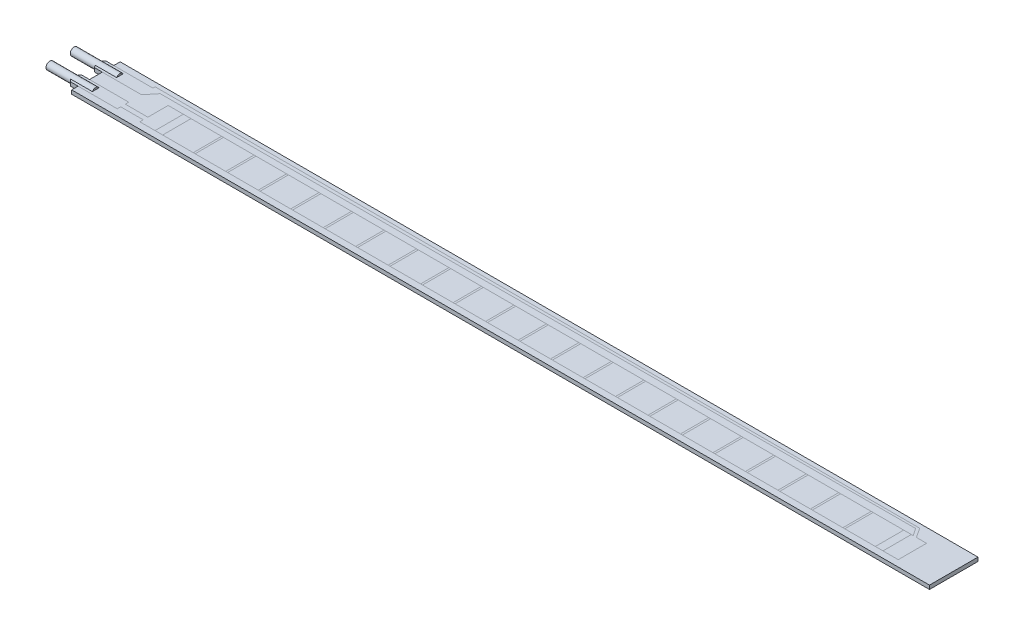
ISO-10303-21;
HEADER;
FILE_DESCRIPTION(('STEP AP214'),'2;1');
FILE_NAME('part.step','',(''),(''),'','','');
FILE_SCHEMA(('AUTOMOTIVE_DESIGN { 1 0 10303 214 1 1 1 1 }'));
ENDSEC;
DATA;
#1=APPLICATION_CONTEXT('core data for automotive mechanical design processes');
#2=APPLICATION_PROTOCOL_DEFINITION('international standard','automotive_design',2000,#1);
#3=PRODUCT_CONTEXT('',#1,'mechanical');
#4=PRODUCT('Part','Part','',(#3));
#5=PRODUCT_RELATED_PRODUCT_CATEGORY('part','',(#4));
#6=PRODUCT_DEFINITION_FORMATION('','',#4);
#7=PRODUCT_DEFINITION_CONTEXT('part definition',#1,'design');
#8=PRODUCT_DEFINITION('design','',#6,#7);
#9=PRODUCT_DEFINITION_SHAPE('','',#8);
#10=(LENGTH_UNIT() NAMED_UNIT(*) SI_UNIT(.MILLI.,.METRE.));
#11=(NAMED_UNIT(*) PLANE_ANGLE_UNIT() SI_UNIT($,.RADIAN.));
#12=(NAMED_UNIT(*) SI_UNIT($,.STERADIAN.) SOLID_ANGLE_UNIT());
#13=UNCERTAINTY_MEASURE_WITH_UNIT(LENGTH_MEASURE(1.E-05),#10,'distance_accuracy_value','');
#14=(GEOMETRIC_REPRESENTATION_CONTEXT(3) GLOBAL_UNCERTAINTY_ASSIGNED_CONTEXT((#13)) GLOBAL_UNIT_ASSIGNED_CONTEXT((#10,
#11,#12)) REPRESENTATION_CONTEXT('',''));
#15=CARTESIAN_POINT('',(0.,0.,0.));
#16=DIRECTION('',(0.,0.,1.));
#17=DIRECTION('',(1.,0.,0.));
#18=AXIS2_PLACEMENT_3D('',#15,#16,#17);
#19=CARTESIAN_POINT('',(-56.12,0.5,3.175));
#20=DIRECTION('',(1.,0.,0.));
#21=DIRECTION('',(0.,0.,-1.));
#22=AXIS2_PLACEMENT_3D('',#19,#20,#21);
#23=PLANE('',#22);
#24=DIRECTION('',(0.,0.,1.));
#25=VECTOR('',#24,1.);
#26=CARTESIAN_POINT('',(-56.12,0.,3.175));
#27=LINE('',#26,#25);
#28=CARTESIAN_POINT('',(-56.12,0.,-3.175));
#29=VERTEX_POINT('',#28);
#30=CARTESIAN_POINT('',(-56.12,0.,-2.3375));
#31=VERTEX_POINT('',#30);
#32=EDGE_CURVE('E807',#29,#31,#27,.T.);
#33=ORIENTED_EDGE('',*,*,#32,.T.);
#34=DIRECTION('',(0.,1.,0.));
#35=VECTOR('',#34,1.);
#36=CARTESIAN_POINT('',(-56.12,0.,-2.3375));
#37=LINE('',#36,#35);
#38=CARTESIAN_POINT('',(-56.12,0.5,-2.3375));
#39=VERTEX_POINT('',#38);
#40=EDGE_CURVE('E861',#31,#39,#37,.T.);
#41=ORIENTED_EDGE('',*,*,#40,.T.);
#42=DIRECTION('',(0.,0.,1.));
#43=VECTOR('',#42,1.);
#44=CARTESIAN_POINT('',(-56.12,0.5,3.175));
#45=LINE('',#44,#43);
#46=CARTESIAN_POINT('',(-56.12,0.5,-3.175));
#47=VERTEX_POINT('',#46);
#48=EDGE_CURVE('E818',#47,#39,#45,.T.);
#49=ORIENTED_EDGE('',*,*,#48,.F.);
#50=DIRECTION('',(0.,-1.,0.));
#51=VECTOR('',#50,1.);
#52=CARTESIAN_POINT('',(-56.12,0.5,-3.175));
#53=LINE('',#52,#51);
#54=EDGE_CURVE('E794',#47,#29,#53,.T.);
#55=ORIENTED_EDGE('',*,*,#54,.T.);
#56=EDGE_LOOP('',(#33,#41,#49,#55));
#57=FACE_BOUND('',#56,.T.);
#58=ADVANCED_FACE('F40',(#57),#23,.F.);
#59=DIRECTION('',(0.,1.,0.));
#60=VECTOR('',#59,1.);
#61=CARTESIAN_POINT('',(-56.12,0.,2.3375));
#62=LINE('',#61,#60);
#63=CARTESIAN_POINT('',(-56.12,0.,2.3375));
#64=VERTEX_POINT('',#63);
#65=CARTESIAN_POINT('',(-56.12,0.5,2.3375));
#66=VERTEX_POINT('',#65);
#67=EDGE_CURVE('E816',#64,#66,#62,.T.);
#68=ORIENTED_EDGE('',*,*,#67,.F.);
#69=CARTESIAN_POINT('',(-56.12,0.,3.175));
#70=VERTEX_POINT('',#69);
#71=EDGE_CURVE('E810',#64,#70,#27,.T.);
#72=ORIENTED_EDGE('',*,*,#71,.T.);
#73=DIRECTION('',(0.,-1.,0.));
#74=VECTOR('',#73,1.);
#75=CARTESIAN_POINT('',(-56.12,0.5,3.175));
#76=LINE('',#75,#74);
#77=CARTESIAN_POINT('',(-56.12,0.5,3.175));
#78=VERTEX_POINT('',#77);
#79=EDGE_CURVE('E797',#78,#70,#76,.T.);
#80=ORIENTED_EDGE('',*,*,#79,.F.);
#81=EDGE_CURVE('E822',#66,#78,#45,.T.);
#82=ORIENTED_EDGE('',*,*,#81,.F.);
#83=EDGE_LOOP('',(#68,#72,#80,#82));
#84=FACE_BOUND('',#83,.T.);
#85=ADVANCED_FACE('F940',(#84),#23,.F.);
#86=CARTESIAN_POINT('',(0.,0.5,0.));
#87=DIRECTION('',(0.,-1.,0.));
#88=DIRECTION('',(0.,0.,-1.));
#89=AXIS2_PLACEMENT_3D('',#86,#87,#88);
#90=PLANE('',#89);
#91=DIRECTION('',(0.,0.,1.));
#92=VECTOR('',#91,1.);
#93=CARTESIAN_POINT('',(44.2025451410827,0.5,0.));
#94=LINE('',#93,#92);
#95=CARTESIAN_POINT('',(44.2025451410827,0.5,-1.37066836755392));
#96=VERTEX_POINT('',#95);
#97=CARTESIAN_POINT('',(44.2025451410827,0.5,2.33750000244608));
#98=VERTEX_POINT('',#97);
#99=EDGE_CURVE('E533',#96,#98,#94,.T.);
#100=ORIENTED_EDGE('',*,*,#99,.F.);
#101=DIRECTION('',(-1.,0.,0.));
#102=VECTOR('',#101,1.);
#103=CARTESIAN_POINT('',(0.,0.5,-1.37066836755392));
#104=LINE('',#103,#102);
#105=CARTESIAN_POINT('',(43.9525451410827,0.5,-1.37066836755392));
#106=VERTEX_POINT('',#105);
#107=EDGE_CURVE('E778',#96,#106,#104,.T.);
#108=ORIENTED_EDGE('',*,*,#107,.T.);
#109=DIRECTION('',(0.,0.,-1.));
#110=VECTOR('',#109,1.);
#111=CARTESIAN_POINT('',(43.9525451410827,0.5,0.));
#112=LINE('',#111,#110);
#113=CARTESIAN_POINT('',(43.9525451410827,0.5,2.33750000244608));
#114=VERTEX_POINT('',#113);
#115=EDGE_CURVE('E537',#114,#106,#112,.T.);
#116=ORIENTED_EDGE('',*,*,#115,.F.);
#117=DIRECTION('',(1.,0.,0.));
#118=VECTOR('',#117,1.);
#119=CARTESIAN_POINT('',(0.,0.5,2.33750000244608));
#120=LINE('',#119,#118);
#121=EDGE_CURVE('E1779',#114,#98,#120,.T.);
#122=ORIENTED_EDGE('',*,*,#121,.T.);
#123=EDGE_LOOP('',(#100,#108,#116,#122));
#124=FACE_BOUND('',#123,.T.);
#125=ADVANCED_FACE('F947',(#124),#90,.F.);
#126=DIRECTION('',(0.,0.,1.));
#127=VECTOR('',#126,1.);
#128=CARTESIAN_POINT('',(39.9525451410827,0.5,0.));
#129=LINE('',#128,#127);
#130=CARTESIAN_POINT('',(39.9525451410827,0.5,-1.37066836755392));
#131=VERTEX_POINT('',#130);
#132=CARTESIAN_POINT('',(39.9525451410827,0.5,2.33750000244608));
#133=VERTEX_POINT('',#132);
#134=EDGE_CURVE('E536',#131,#133,#129,.T.);
#135=ORIENTED_EDGE('',*,*,#134,.F.);
#136=CARTESIAN_POINT('',(39.7025451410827,0.5,-1.37066836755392));
#137=VERTEX_POINT('',#136);
#138=EDGE_CURVE('E2198',#131,#137,#104,.T.);
#139=ORIENTED_EDGE('',*,*,#138,.T.);
#140=DIRECTION('',(0.,0.,-1.));
#141=VECTOR('',#140,1.);
#142=CARTESIAN_POINT('',(39.7025451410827,0.5,0.));
#143=LINE('',#142,#141);
#144=CARTESIAN_POINT('',(39.7025451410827,0.5,2.33750000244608));
#145=VERTEX_POINT('',#144);
#146=EDGE_CURVE('E544',#145,#137,#143,.T.);
#147=ORIENTED_EDGE('',*,*,#146,.F.);
#148=EDGE_CURVE('E1794',#145,#133,#120,.T.);
#149=ORIENTED_EDGE('',*,*,#148,.T.);
#150=EDGE_LOOP('',(#135,#139,#147,#149));
#151=FACE_BOUND('',#150,.T.);
#152=ADVANCED_FACE('F1466',(#151),#90,.F.);
#153=CARTESIAN_POINT('',(48.2025451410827,0.5,-1.37066836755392));
#154=VERTEX_POINT('',#153);
#155=EDGE_CURVE('E777',#154,#96,#104,.T.);
#156=ORIENTED_EDGE('',*,*,#155,.T.);
#157=ORIENTED_EDGE('',*,*,#99,.T.);
#158=CARTESIAN_POINT('',(48.2025451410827,0.5,2.33750000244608));
#159=VERTEX_POINT('',#158);
#160=EDGE_CURVE('E789',#98,#159,#120,.T.);
#161=ORIENTED_EDGE('',*,*,#160,.T.);
#162=DIRECTION('',(0.,0.,1.));
#163=VECTOR('',#162,1.);
#164=CARTESIAN_POINT('',(48.2025451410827,0.5,0.));
#165=LINE('',#164,#163);
#166=EDGE_CURVE('E680',#154,#159,#165,.T.);
#167=ORIENTED_EDGE('',*,*,#166,.F.);
#168=EDGE_LOOP('',(#156,#157,#161,#167));
#169=FACE_BOUND('',#168,.T.);
#170=ADVANCED_FACE('F1459',(#169),#90,.F.);
#171=DIRECTION('',(0.,0.,1.));
#172=VECTOR('',#171,1.);
#173=CARTESIAN_POINT('',(35.7025451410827,0.5,0.));
#174=LINE('',#173,#172);
#175=CARTESIAN_POINT('',(35.7025451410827,0.5,-1.37066836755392));
#176=VERTEX_POINT('',#175);
#177=CARTESIAN_POINT('',(35.7025451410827,0.5,2.33750000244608));
#178=VERTEX_POINT('',#177);
#179=EDGE_CURVE('E541',#176,#178,#174,.T.);
#180=ORIENTED_EDGE('',*,*,#179,.F.);
#181=CARTESIAN_POINT('',(35.4525451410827,0.5,-1.37066836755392));
#182=VERTEX_POINT('',#181);
#183=EDGE_CURVE('E2188',#176,#182,#104,.T.);
#184=ORIENTED_EDGE('',*,*,#183,.T.);
#185=DIRECTION('',(0.,0.,-1.));
#186=VECTOR('',#185,1.);
#187=CARTESIAN_POINT('',(35.4525451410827,0.5,0.));
#188=LINE('',#187,#186);
#189=CARTESIAN_POINT('',(35.4525451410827,0.5,2.33750000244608));
#190=VERTEX_POINT('',#189);
#191=EDGE_CURVE('E551',#190,#182,#188,.T.);
#192=ORIENTED_EDGE('',*,*,#191,.F.);
#193=EDGE_CURVE('E1808',#190,#178,#120,.T.);
#194=ORIENTED_EDGE('',*,*,#193,.T.);
#195=EDGE_LOOP('',(#180,#184,#192,#194));
#196=FACE_BOUND('',#195,.T.);
#197=ADVANCED_FACE('F1454',(#196),#90,.F.);
#198=EDGE_CURVE('E2193',#106,#131,#104,.T.);
#199=ORIENTED_EDGE('',*,*,#198,.T.);
#200=ORIENTED_EDGE('',*,*,#134,.T.);
#201=EDGE_CURVE('E1787',#133,#114,#120,.T.);
#202=ORIENTED_EDGE('',*,*,#201,.T.);
#203=ORIENTED_EDGE('',*,*,#115,.T.);
#204=EDGE_LOOP('',(#199,#200,#202,#203));
#205=FACE_BOUND('',#204,.T.);
#206=ADVANCED_FACE('F1447',(#205),#90,.F.);
#207=DIRECTION('',(0.,0.,1.));
#208=VECTOR('',#207,1.);
#209=CARTESIAN_POINT('',(31.4525451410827,0.5,0.));
#210=LINE('',#209,#208);
#211=CARTESIAN_POINT('',(31.4525451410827,0.5,-1.37066836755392));
#212=VERTEX_POINT('',#211);
#213=CARTESIAN_POINT('',(31.4525451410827,0.5,2.33750000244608));
#214=VERTEX_POINT('',#213);
#215=EDGE_CURVE('E548',#212,#214,#210,.T.);
#216=ORIENTED_EDGE('',*,*,#215,.F.);
#217=CARTESIAN_POINT('',(31.2025451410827,0.5,-1.37066836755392));
#218=VERTEX_POINT('',#217);
#219=EDGE_CURVE('E2186',#212,#218,#104,.T.);
#220=ORIENTED_EDGE('',*,*,#219,.T.);
#221=DIRECTION('',(0.,0.,-1.));
#222=VECTOR('',#221,1.);
#223=CARTESIAN_POINT('',(31.2025451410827,0.5,0.));
#224=LINE('',#223,#222);
#225=CARTESIAN_POINT('',(31.2025451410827,0.5,2.33750000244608));
#226=VERTEX_POINT('',#225);
#227=EDGE_CURVE('E558',#226,#218,#224,.T.);
#228=ORIENTED_EDGE('',*,*,#227,.F.);
#229=EDGE_CURVE('E1822',#226,#214,#120,.T.);
#230=ORIENTED_EDGE('',*,*,#229,.T.);
#231=EDGE_LOOP('',(#216,#220,#228,#230));
#232=FACE_BOUND('',#231,.T.);
#233=ADVANCED_FACE('F1442',(#232),#90,.F.);
#234=EDGE_CURVE('E2192',#137,#176,#104,.T.);
#235=ORIENTED_EDGE('',*,*,#234,.T.);
#236=ORIENTED_EDGE('',*,*,#179,.T.);
#237=EDGE_CURVE('E1801',#178,#145,#120,.T.);
#238=ORIENTED_EDGE('',*,*,#237,.T.);
#239=ORIENTED_EDGE('',*,*,#146,.T.);
#240=EDGE_LOOP('',(#235,#236,#238,#239));
#241=FACE_BOUND('',#240,.T.);
#242=ADVANCED_FACE('F1435',(#241),#90,.F.);
#243=DIRECTION('',(0.,0.,1.));
#244=VECTOR('',#243,1.);
#245=CARTESIAN_POINT('',(27.2025451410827,0.5,0.));
#246=LINE('',#245,#244);
#247=CARTESIAN_POINT('',(27.2025451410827,0.5,-1.37066836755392));
#248=VERTEX_POINT('',#247);
#249=CARTESIAN_POINT('',(27.2025451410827,0.5,2.33750000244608));
#250=VERTEX_POINT('',#249);
#251=EDGE_CURVE('E555',#248,#250,#246,.T.);
#252=ORIENTED_EDGE('',*,*,#251,.F.);
#253=CARTESIAN_POINT('',(26.9525451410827,0.5,-1.37066836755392));
#254=VERTEX_POINT('',#253);
#255=EDGE_CURVE('E2177',#248,#254,#104,.T.);
#256=ORIENTED_EDGE('',*,*,#255,.T.);
#257=DIRECTION('',(0.,0.,-1.));
#258=VECTOR('',#257,1.);
#259=CARTESIAN_POINT('',(26.9525451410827,0.5,0.));
#260=LINE('',#259,#258);
#261=CARTESIAN_POINT('',(26.9525451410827,0.5,2.33750000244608));
#262=VERTEX_POINT('',#261);
#263=EDGE_CURVE('E565',#262,#254,#260,.T.);
#264=ORIENTED_EDGE('',*,*,#263,.F.);
#265=EDGE_CURVE('E1836',#262,#250,#120,.T.);
#266=ORIENTED_EDGE('',*,*,#265,.T.);
#267=EDGE_LOOP('',(#252,#256,#264,#266));
#268=FACE_BOUND('',#267,.T.);
#269=ADVANCED_FACE('F1430',(#268),#90,.F.);
#270=EDGE_CURVE('E2181',#182,#212,#104,.T.);
#271=ORIENTED_EDGE('',*,*,#270,.T.);
#272=ORIENTED_EDGE('',*,*,#215,.T.);
#273=EDGE_CURVE('E1815',#214,#190,#120,.T.);
#274=ORIENTED_EDGE('',*,*,#273,.T.);
#275=ORIENTED_EDGE('',*,*,#191,.T.);
#276=EDGE_LOOP('',(#271,#272,#274,#275));
#277=FACE_BOUND('',#276,.T.);
#278=ADVANCED_FACE('F1423',(#277),#90,.F.);
#279=DIRECTION('',(0.,0.,1.));
#280=VECTOR('',#279,1.);
#281=CARTESIAN_POINT('',(22.9525451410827,0.5,0.));
#282=LINE('',#281,#280);
#283=CARTESIAN_POINT('',(22.9525451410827,0.5,-1.37066836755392));
#284=VERTEX_POINT('',#283);
#285=CARTESIAN_POINT('',(22.9525451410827,0.5,2.33750000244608));
#286=VERTEX_POINT('',#285);
#287=EDGE_CURVE('E562',#284,#286,#282,.T.);
#288=ORIENTED_EDGE('',*,*,#287,.F.);
#289=CARTESIAN_POINT('',(22.7025451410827,0.5,-1.37066836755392));
#290=VERTEX_POINT('',#289);
#291=EDGE_CURVE('E2167',#284,#290,#104,.T.);
#292=ORIENTED_EDGE('',*,*,#291,.T.);
#293=DIRECTION('',(0.,0.,-1.));
#294=VECTOR('',#293,1.);
#295=CARTESIAN_POINT('',(22.7025451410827,0.5,0.));
#296=LINE('',#295,#294);
#297=CARTESIAN_POINT('',(22.7025451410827,0.5,2.33750000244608));
#298=VERTEX_POINT('',#297);
#299=EDGE_CURVE('E572',#298,#290,#296,.T.);
#300=ORIENTED_EDGE('',*,*,#299,.F.);
#301=EDGE_CURVE('E1850',#298,#286,#120,.T.);
#302=ORIENTED_EDGE('',*,*,#301,.T.);
#303=EDGE_LOOP('',(#288,#292,#300,#302));
#304=FACE_BOUND('',#303,.T.);
#305=ADVANCED_FACE('F1418',(#304),#90,.F.);
#306=EDGE_CURVE('E2172',#218,#248,#104,.T.);
#307=ORIENTED_EDGE('',*,*,#306,.T.);
#308=ORIENTED_EDGE('',*,*,#251,.T.);
#309=EDGE_CURVE('E1829',#250,#226,#120,.T.);
#310=ORIENTED_EDGE('',*,*,#309,.T.);
#311=ORIENTED_EDGE('',*,*,#227,.T.);
#312=EDGE_LOOP('',(#307,#308,#310,#311));
#313=FACE_BOUND('',#312,.T.);
#314=ADVANCED_FACE('F1411',(#313),#90,.F.);
#315=DIRECTION('',(0.,0.,1.));
#316=VECTOR('',#315,1.);
#317=CARTESIAN_POINT('',(18.7025451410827,0.5,0.));
#318=LINE('',#317,#316);
#319=CARTESIAN_POINT('',(18.7025451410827,0.5,-1.37066836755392));
#320=VERTEX_POINT('',#319);
#321=CARTESIAN_POINT('',(18.7025451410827,0.5,2.33750000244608));
#322=VERTEX_POINT('',#321);
#323=EDGE_CURVE('E569',#320,#322,#318,.T.);
#324=ORIENTED_EDGE('',*,*,#323,.F.);
#325=CARTESIAN_POINT('',(18.4525451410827,0.5,-1.37066836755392));
#326=VERTEX_POINT('',#325);
#327=EDGE_CURVE('E2165',#320,#326,#104,.T.);
#328=ORIENTED_EDGE('',*,*,#327,.T.);
#329=DIRECTION('',(0.,0.,-1.));
#330=VECTOR('',#329,1.);
#331=CARTESIAN_POINT('',(18.4525451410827,0.5,0.));
#332=LINE('',#331,#330);
#333=CARTESIAN_POINT('',(18.4525451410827,0.5,2.33750000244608));
#334=VERTEX_POINT('',#333);
#335=EDGE_CURVE('E579',#334,#326,#332,.T.);
#336=ORIENTED_EDGE('',*,*,#335,.F.);
#337=EDGE_CURVE('E1864',#334,#322,#120,.T.);
#338=ORIENTED_EDGE('',*,*,#337,.T.);
#339=EDGE_LOOP('',(#324,#328,#336,#338));
#340=FACE_BOUND('',#339,.T.);
#341=ADVANCED_FACE('F1406',(#340),#90,.F.);
#342=EDGE_CURVE('E2171',#254,#284,#104,.T.);
#343=ORIENTED_EDGE('',*,*,#342,.T.);
#344=ORIENTED_EDGE('',*,*,#287,.T.);
#345=EDGE_CURVE('E1843',#286,#262,#120,.T.);
#346=ORIENTED_EDGE('',*,*,#345,.T.);
#347=ORIENTED_EDGE('',*,*,#263,.T.);
#348=EDGE_LOOP('',(#343,#344,#346,#347));
#349=FACE_BOUND('',#348,.T.);
#350=ADVANCED_FACE('F1399',(#349),#90,.F.);
#351=DIRECTION('',(0.,0.,1.));
#352=VECTOR('',#351,1.);
#353=CARTESIAN_POINT('',(14.4525451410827,0.5,0.));
#354=LINE('',#353,#352);
#355=CARTESIAN_POINT('',(14.4525451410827,0.5,-1.37066836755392));
#356=VERTEX_POINT('',#355);
#357=CARTESIAN_POINT('',(14.4525451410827,0.5,2.33750000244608));
#358=VERTEX_POINT('',#357);
#359=EDGE_CURVE('E576',#356,#358,#354,.T.);
#360=ORIENTED_EDGE('',*,*,#359,.F.);
#361=CARTESIAN_POINT('',(14.2025451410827,0.5,-1.37066836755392));
#362=VERTEX_POINT('',#361);
#363=EDGE_CURVE('E2156',#356,#362,#104,.T.);
#364=ORIENTED_EDGE('',*,*,#363,.T.);
#365=DIRECTION('',(0.,0.,-1.));
#366=VECTOR('',#365,1.);
#367=CARTESIAN_POINT('',(14.2025451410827,0.5,0.));
#368=LINE('',#367,#366);
#369=CARTESIAN_POINT('',(14.2025451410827,0.5,2.33750000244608));
#370=VERTEX_POINT('',#369);
#371=EDGE_CURVE('E586',#370,#362,#368,.T.);
#372=ORIENTED_EDGE('',*,*,#371,.F.);
#373=EDGE_CURVE('E1878',#370,#358,#120,.T.);
#374=ORIENTED_EDGE('',*,*,#373,.T.);
#375=EDGE_LOOP('',(#360,#364,#372,#374));
#376=FACE_BOUND('',#375,.T.);
#377=ADVANCED_FACE('F1394',(#376),#90,.F.);
#378=EDGE_CURVE('E2160',#290,#320,#104,.T.);
#379=ORIENTED_EDGE('',*,*,#378,.T.);
#380=ORIENTED_EDGE('',*,*,#323,.T.);
#381=EDGE_CURVE('E1857',#322,#298,#120,.T.);
#382=ORIENTED_EDGE('',*,*,#381,.T.);
#383=ORIENTED_EDGE('',*,*,#299,.T.);
#384=EDGE_LOOP('',(#379,#380,#382,#383));
#385=FACE_BOUND('',#384,.T.);
#386=ADVANCED_FACE('F1387',(#385),#90,.F.);
#387=DIRECTION('',(0.,0.,1.));
#388=VECTOR('',#387,1.);
#389=CARTESIAN_POINT('',(10.2025451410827,0.5,0.));
#390=LINE('',#389,#388);
#391=CARTESIAN_POINT('',(10.2025451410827,0.5,-1.37066836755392));
#392=VERTEX_POINT('',#391);
#393=CARTESIAN_POINT('',(10.2025451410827,0.5,2.33750000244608));
#394=VERTEX_POINT('',#393);
#395=EDGE_CURVE('E583',#392,#394,#390,.T.);
#396=ORIENTED_EDGE('',*,*,#395,.F.);
#397=CARTESIAN_POINT('',(9.95254514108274,0.5,-1.37066836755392));
#398=VERTEX_POINT('',#397);
#399=EDGE_CURVE('E2146',#392,#398,#104,.T.);
#400=ORIENTED_EDGE('',*,*,#399,.T.);
#401=DIRECTION('',(0.,0.,-1.));
#402=VECTOR('',#401,1.);
#403=CARTESIAN_POINT('',(9.95254514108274,0.5,0.));
#404=LINE('',#403,#402);
#405=CARTESIAN_POINT('',(9.95254514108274,0.5,2.33750000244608));
#406=VERTEX_POINT('',#405);
#407=EDGE_CURVE('E593',#406,#398,#404,.T.);
#408=ORIENTED_EDGE('',*,*,#407,.F.);
#409=EDGE_CURVE('E1892',#406,#394,#120,.T.);
#410=ORIENTED_EDGE('',*,*,#409,.T.);
#411=EDGE_LOOP('',(#396,#400,#408,#410));
#412=FACE_BOUND('',#411,.T.);
#413=ADVANCED_FACE('F1382',(#412),#90,.F.);
#414=EDGE_CURVE('E2151',#326,#356,#104,.T.);
#415=ORIENTED_EDGE('',*,*,#414,.T.);
#416=ORIENTED_EDGE('',*,*,#359,.T.);
#417=EDGE_CURVE('E1871',#358,#334,#120,.T.);
#418=ORIENTED_EDGE('',*,*,#417,.T.);
#419=ORIENTED_EDGE('',*,*,#335,.T.);
#420=EDGE_LOOP('',(#415,#416,#418,#419));
#421=FACE_BOUND('',#420,.T.);
#422=ADVANCED_FACE('F1375',(#421),#90,.F.);
#423=DIRECTION('',(0.,0.,1.));
#424=VECTOR('',#423,1.);
#425=CARTESIAN_POINT('',(5.95254514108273,0.5,0.));
#426=LINE('',#425,#424);
#427=CARTESIAN_POINT('',(5.95254514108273,0.5,-1.37066836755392));
#428=VERTEX_POINT('',#427);
#429=CARTESIAN_POINT('',(5.95254514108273,0.5,2.33750000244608));
#430=VERTEX_POINT('',#429);
#431=EDGE_CURVE('E590',#428,#430,#426,.T.);
#432=ORIENTED_EDGE('',*,*,#431,.F.);
#433=CARTESIAN_POINT('',(5.70254514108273,0.5,-1.37066836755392));
#434=VERTEX_POINT('',#433);
#435=EDGE_CURVE('E2144',#428,#434,#104,.T.);
#436=ORIENTED_EDGE('',*,*,#435,.T.);
#437=DIRECTION('',(0.,0.,-1.));
#438=VECTOR('',#437,1.);
#439=CARTESIAN_POINT('',(5.70254514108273,0.5,0.));
#440=LINE('',#439,#438);
#441=CARTESIAN_POINT('',(5.70254514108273,0.5,2.33750000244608));
#442=VERTEX_POINT('',#441);
#443=EDGE_CURVE('E600',#442,#434,#440,.T.);
#444=ORIENTED_EDGE('',*,*,#443,.F.);
#445=EDGE_CURVE('E1906',#442,#430,#120,.T.);
#446=ORIENTED_EDGE('',*,*,#445,.T.);
#447=EDGE_LOOP('',(#432,#436,#444,#446));
#448=FACE_BOUND('',#447,.T.);
#449=ADVANCED_FACE('F1370',(#448),#90,.F.);
#450=EDGE_CURVE('E2150',#362,#392,#104,.T.);
#451=ORIENTED_EDGE('',*,*,#450,.T.);
#452=ORIENTED_EDGE('',*,*,#395,.T.);
#453=EDGE_CURVE('E1885',#394,#370,#120,.T.);
#454=ORIENTED_EDGE('',*,*,#453,.T.);
#455=ORIENTED_EDGE('',*,*,#371,.T.);
#456=EDGE_LOOP('',(#451,#452,#454,#455));
#457=FACE_BOUND('',#456,.T.);
#458=ADVANCED_FACE('F1363',(#457),#90,.F.);
#459=DIRECTION('',(0.,0.,1.));
#460=VECTOR('',#459,1.);
#461=CARTESIAN_POINT('',(1.70254514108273,0.5,0.));
#462=LINE('',#461,#460);
#463=CARTESIAN_POINT('',(1.70254514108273,0.5,-1.37066836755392));
#464=VERTEX_POINT('',#463);
#465=CARTESIAN_POINT('',(1.70254514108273,0.5,2.33750000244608));
#466=VERTEX_POINT('',#465);
#467=EDGE_CURVE('E597',#464,#466,#462,.T.);
#468=ORIENTED_EDGE('',*,*,#467,.F.);
#469=CARTESIAN_POINT('',(1.45254514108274,0.5,-1.37066836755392));
#470=VERTEX_POINT('',#469);
#471=EDGE_CURVE('E2135',#464,#470,#104,.T.);
#472=ORIENTED_EDGE('',*,*,#471,.T.);
#473=DIRECTION('',(0.,0.,-1.));
#474=VECTOR('',#473,1.);
#475=CARTESIAN_POINT('',(1.45254514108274,0.5,0.));
#476=LINE('',#475,#474);
#477=CARTESIAN_POINT('',(1.45254514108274,0.5,2.33750000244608));
#478=VERTEX_POINT('',#477);
#479=EDGE_CURVE('E607',#478,#470,#476,.T.);
#480=ORIENTED_EDGE('',*,*,#479,.F.);
#481=EDGE_CURVE('E1920',#478,#466,#120,.T.);
#482=ORIENTED_EDGE('',*,*,#481,.T.);
#483=EDGE_LOOP('',(#468,#472,#480,#482));
#484=FACE_BOUND('',#483,.T.);
#485=ADVANCED_FACE('F1358',(#484),#90,.F.);
#486=EDGE_CURVE('E2139',#398,#428,#104,.T.);
#487=ORIENTED_EDGE('',*,*,#486,.T.);
#488=ORIENTED_EDGE('',*,*,#431,.T.);
#489=EDGE_CURVE('E1899',#430,#406,#120,.T.);
#490=ORIENTED_EDGE('',*,*,#489,.T.);
#491=ORIENTED_EDGE('',*,*,#407,.T.);
#492=EDGE_LOOP('',(#487,#488,#490,#491));
#493=FACE_BOUND('',#492,.T.);
#494=ADVANCED_FACE('F1351',(#493),#90,.F.);
#495=DIRECTION('',(0.,0.,1.));
#496=VECTOR('',#495,1.);
#497=CARTESIAN_POINT('',(-2.54745485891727,0.5,0.));
#498=LINE('',#497,#496);
#499=CARTESIAN_POINT('',(-2.54745485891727,0.5,-1.37066836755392));
#500=VERTEX_POINT('',#499);
#501=CARTESIAN_POINT('',(-2.54745485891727,0.5,2.33750000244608));
#502=VERTEX_POINT('',#501);
#503=EDGE_CURVE('E604',#500,#502,#498,.T.);
#504=ORIENTED_EDGE('',*,*,#503,.F.);
#505=CARTESIAN_POINT('',(-2.79745485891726,0.5,-1.37066836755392));
#506=VERTEX_POINT('',#505);
#507=EDGE_CURVE('E2125',#500,#506,#104,.T.);
#508=ORIENTED_EDGE('',*,*,#507,.T.);
#509=DIRECTION('',(0.,0.,-1.));
#510=VECTOR('',#509,1.);
#511=CARTESIAN_POINT('',(-2.79745485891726,0.5,0.));
#512=LINE('',#511,#510);
#513=CARTESIAN_POINT('',(-2.79745485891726,0.5,2.33750000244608));
#514=VERTEX_POINT('',#513);
#515=EDGE_CURVE('E614',#514,#506,#512,.T.);
#516=ORIENTED_EDGE('',*,*,#515,.F.);
#517=EDGE_CURVE('E1934',#514,#502,#120,.T.);
#518=ORIENTED_EDGE('',*,*,#517,.T.);
#519=EDGE_LOOP('',(#504,#508,#516,#518));
#520=FACE_BOUND('',#519,.T.);
#521=ADVANCED_FACE('F1346',(#520),#90,.F.);
#522=EDGE_CURVE('E2130',#434,#464,#104,.T.);
#523=ORIENTED_EDGE('',*,*,#522,.T.);
#524=ORIENTED_EDGE('',*,*,#467,.T.);
#525=EDGE_CURVE('E1913',#466,#442,#120,.T.);
#526=ORIENTED_EDGE('',*,*,#525,.T.);
#527=ORIENTED_EDGE('',*,*,#443,.T.);
#528=EDGE_LOOP('',(#523,#524,#526,#527));
#529=FACE_BOUND('',#528,.T.);
#530=ADVANCED_FACE('F1339',(#529),#90,.F.);
#531=DIRECTION('',(0.,0.,1.));
#532=VECTOR('',#531,1.);
#533=CARTESIAN_POINT('',(-6.79745485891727,0.5,0.));
#534=LINE('',#533,#532);
#535=CARTESIAN_POINT('',(-6.79745485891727,0.5,-1.37066836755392));
#536=VERTEX_POINT('',#535);
#537=CARTESIAN_POINT('',(-6.79745485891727,0.5,2.33750000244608));
#538=VERTEX_POINT('',#537);
#539=EDGE_CURVE('E611',#536,#538,#534,.T.);
#540=ORIENTED_EDGE('',*,*,#539,.F.);
#541=CARTESIAN_POINT('',(-7.04745485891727,0.5,-1.37066836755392));
#542=VERTEX_POINT('',#541);
#543=EDGE_CURVE('E2123',#536,#542,#104,.T.);
#544=ORIENTED_EDGE('',*,*,#543,.T.);
#545=DIRECTION('',(0.,0.,-1.));
#546=VECTOR('',#545,1.);
#547=CARTESIAN_POINT('',(-7.04745485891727,0.5,0.));
#548=LINE('',#547,#546);
#549=CARTESIAN_POINT('',(-7.04745485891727,0.5,2.33750000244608));
#550=VERTEX_POINT('',#549);
#551=EDGE_CURVE('E621',#550,#542,#548,.T.);
#552=ORIENTED_EDGE('',*,*,#551,.F.);
#553=EDGE_CURVE('E1948',#550,#538,#120,.T.);
#554=ORIENTED_EDGE('',*,*,#553,.T.);
#555=EDGE_LOOP('',(#540,#544,#552,#554));
#556=FACE_BOUND('',#555,.T.);
#557=ADVANCED_FACE('F1334',(#556),#90,.F.);
#558=EDGE_CURVE('E2129',#470,#500,#104,.T.);
#559=ORIENTED_EDGE('',*,*,#558,.T.);
#560=ORIENTED_EDGE('',*,*,#503,.T.);
#561=EDGE_CURVE('E1927',#502,#478,#120,.T.);
#562=ORIENTED_EDGE('',*,*,#561,.T.);
#563=ORIENTED_EDGE('',*,*,#479,.T.);
#564=EDGE_LOOP('',(#559,#560,#562,#563));
#565=FACE_BOUND('',#564,.T.);
#566=ADVANCED_FACE('F1327',(#565),#90,.F.);
#567=DIRECTION('',(0.,0.,1.));
#568=VECTOR('',#567,1.);
#569=CARTESIAN_POINT('',(-11.0474548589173,0.5,0.));
#570=LINE('',#569,#568);
#571=CARTESIAN_POINT('',(-11.0474548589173,0.5,-1.37066836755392));
#572=VERTEX_POINT('',#571);
#573=CARTESIAN_POINT('',(-11.0474548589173,0.5,2.33750000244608));
#574=VERTEX_POINT('',#573);
#575=EDGE_CURVE('E618',#572,#574,#570,.T.);
#576=ORIENTED_EDGE('',*,*,#575,.F.);
#577=CARTESIAN_POINT('',(-11.2974548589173,0.5,-1.37066836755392));
#578=VERTEX_POINT('',#577);
#579=EDGE_CURVE('E2114',#572,#578,#104,.T.);
#580=ORIENTED_EDGE('',*,*,#579,.T.);
#581=DIRECTION('',(0.,0.,-1.));
#582=VECTOR('',#581,1.);
#583=CARTESIAN_POINT('',(-11.2974548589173,0.5,0.));
#584=LINE('',#583,#582);
#585=CARTESIAN_POINT('',(-11.2974548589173,0.5,2.33750000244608));
#586=VERTEX_POINT('',#585);
#587=EDGE_CURVE('E628',#586,#578,#584,.T.);
#588=ORIENTED_EDGE('',*,*,#587,.F.);
#589=EDGE_CURVE('E1962',#586,#574,#120,.T.);
#590=ORIENTED_EDGE('',*,*,#589,.T.);
#591=EDGE_LOOP('',(#576,#580,#588,#590));
#592=FACE_BOUND('',#591,.T.);
#593=ADVANCED_FACE('F1322',(#592),#90,.F.);
#594=EDGE_CURVE('E2118',#506,#536,#104,.T.);
#595=ORIENTED_EDGE('',*,*,#594,.T.);
#596=ORIENTED_EDGE('',*,*,#539,.T.);
#597=EDGE_CURVE('E1941',#538,#514,#120,.T.);
#598=ORIENTED_EDGE('',*,*,#597,.T.);
#599=ORIENTED_EDGE('',*,*,#515,.T.);
#600=EDGE_LOOP('',(#595,#596,#598,#599));
#601=FACE_BOUND('',#600,.T.);
#602=ADVANCED_FACE('F1315',(#601),#90,.F.);
#603=DIRECTION('',(0.,0.,1.));
#604=VECTOR('',#603,1.);
#605=CARTESIAN_POINT('',(-15.2974548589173,0.5,0.));
#606=LINE('',#605,#604);
#607=CARTESIAN_POINT('',(-15.2974548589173,0.5,-1.37066836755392));
#608=VERTEX_POINT('',#607);
#609=CARTESIAN_POINT('',(-15.2974548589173,0.5,2.33750000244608));
#610=VERTEX_POINT('',#609);
#611=EDGE_CURVE('E625',#608,#610,#606,.T.);
#612=ORIENTED_EDGE('',*,*,#611,.F.);
#613=CARTESIAN_POINT('',(-15.5474548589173,0.5,-1.37066836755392));
#614=VERTEX_POINT('',#613);
#615=EDGE_CURVE('E2104',#608,#614,#104,.T.);
#616=ORIENTED_EDGE('',*,*,#615,.T.);
#617=DIRECTION('',(0.,0.,-1.));
#618=VECTOR('',#617,1.);
#619=CARTESIAN_POINT('',(-15.5474548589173,0.5,0.));
#620=LINE('',#619,#618);
#621=CARTESIAN_POINT('',(-15.5474548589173,0.5,2.33750000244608));
#622=VERTEX_POINT('',#621);
#623=EDGE_CURVE('E635',#622,#614,#620,.T.);
#624=ORIENTED_EDGE('',*,*,#623,.F.);
#625=EDGE_CURVE('E1976',#622,#610,#120,.T.);
#626=ORIENTED_EDGE('',*,*,#625,.T.);
#627=EDGE_LOOP('',(#612,#616,#624,#626));
#628=FACE_BOUND('',#627,.T.);
#629=ADVANCED_FACE('F1310',(#628),#90,.F.);
#630=EDGE_CURVE('E2109',#542,#572,#104,.T.);
#631=ORIENTED_EDGE('',*,*,#630,.T.);
#632=ORIENTED_EDGE('',*,*,#575,.T.);
#633=EDGE_CURVE('E1955',#574,#550,#120,.T.);
#634=ORIENTED_EDGE('',*,*,#633,.T.);
#635=ORIENTED_EDGE('',*,*,#551,.T.);
#636=EDGE_LOOP('',(#631,#632,#634,#635));
#637=FACE_BOUND('',#636,.T.);
#638=ADVANCED_FACE('F1303',(#637),#90,.F.);
#639=DIRECTION('',(0.,0.,1.));
#640=VECTOR('',#639,1.);
#641=CARTESIAN_POINT('',(-19.5474548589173,0.5,0.));
#642=LINE('',#641,#640);
#643=CARTESIAN_POINT('',(-19.5474548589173,0.5,-1.37066836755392));
#644=VERTEX_POINT('',#643);
#645=CARTESIAN_POINT('',(-19.5474548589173,0.5,2.33750000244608));
#646=VERTEX_POINT('',#645);
#647=EDGE_CURVE('E632',#644,#646,#642,.T.);
#648=ORIENTED_EDGE('',*,*,#647,.F.);
#649=CARTESIAN_POINT('',(-19.7974548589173,0.5,-1.37066836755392));
#650=VERTEX_POINT('',#649);
#651=EDGE_CURVE('E2102',#644,#650,#104,.T.);
#652=ORIENTED_EDGE('',*,*,#651,.T.);
#653=DIRECTION('',(0.,0.,-1.));
#654=VECTOR('',#653,1.);
#655=CARTESIAN_POINT('',(-19.7974548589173,0.5,0.));
#656=LINE('',#655,#654);
#657=CARTESIAN_POINT('',(-19.7974548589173,0.5,2.33750000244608));
#658=VERTEX_POINT('',#657);
#659=EDGE_CURVE('E642',#658,#650,#656,.T.);
#660=ORIENTED_EDGE('',*,*,#659,.F.);
#661=EDGE_CURVE('E1990',#658,#646,#120,.T.);
#662=ORIENTED_EDGE('',*,*,#661,.T.);
#663=EDGE_LOOP('',(#648,#652,#660,#662));
#664=FACE_BOUND('',#663,.T.);
#665=ADVANCED_FACE('F1298',(#664),#90,.F.);
#666=EDGE_CURVE('E2108',#578,#608,#104,.T.);
#667=ORIENTED_EDGE('',*,*,#666,.T.);
#668=ORIENTED_EDGE('',*,*,#611,.T.);
#669=EDGE_CURVE('E1969',#610,#586,#120,.T.);
#670=ORIENTED_EDGE('',*,*,#669,.T.);
#671=ORIENTED_EDGE('',*,*,#587,.T.);
#672=EDGE_LOOP('',(#667,#668,#670,#671));
#673=FACE_BOUND('',#672,.T.);
#674=ADVANCED_FACE('F1291',(#673),#90,.F.);
#675=DIRECTION('',(0.,0.,1.));
#676=VECTOR('',#675,1.);
#677=CARTESIAN_POINT('',(-23.7974548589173,0.5,0.));
#678=LINE('',#677,#676);
#679=CARTESIAN_POINT('',(-23.7974548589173,0.5,-1.37066836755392));
#680=VERTEX_POINT('',#679);
#681=CARTESIAN_POINT('',(-23.7974548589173,0.5,2.33750000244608));
#682=VERTEX_POINT('',#681);
#683=EDGE_CURVE('E639',#680,#682,#678,.T.);
#684=ORIENTED_EDGE('',*,*,#683,.F.);
#685=CARTESIAN_POINT('',(-24.0474548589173,0.5,-1.37066836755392));
#686=VERTEX_POINT('',#685);
#687=EDGE_CURVE('E2093',#680,#686,#104,.T.);
#688=ORIENTED_EDGE('',*,*,#687,.T.);
#689=DIRECTION('',(0.,0.,-1.));
#690=VECTOR('',#689,1.);
#691=CARTESIAN_POINT('',(-24.0474548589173,0.5,0.));
#692=LINE('',#691,#690);
#693=CARTESIAN_POINT('',(-24.0474548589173,0.5,2.33750000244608));
#694=VERTEX_POINT('',#693);
#695=EDGE_CURVE('E649',#694,#686,#692,.T.);
#696=ORIENTED_EDGE('',*,*,#695,.F.);
#697=EDGE_CURVE('E2004',#694,#682,#120,.T.);
#698=ORIENTED_EDGE('',*,*,#697,.T.);
#699=EDGE_LOOP('',(#684,#688,#696,#698));
#700=FACE_BOUND('',#699,.T.);
#701=ADVANCED_FACE('F1286',(#700),#90,.F.);
#702=EDGE_CURVE('E2097',#614,#644,#104,.T.);
#703=ORIENTED_EDGE('',*,*,#702,.T.);
#704=ORIENTED_EDGE('',*,*,#647,.T.);
#705=EDGE_CURVE('E1983',#646,#622,#120,.T.);
#706=ORIENTED_EDGE('',*,*,#705,.T.);
#707=ORIENTED_EDGE('',*,*,#623,.T.);
#708=EDGE_LOOP('',(#703,#704,#706,#707));
#709=FACE_BOUND('',#708,.T.);
#710=ADVANCED_FACE('F1279',(#709),#90,.F.);
#711=DIRECTION('',(0.,0.,1.));
#712=VECTOR('',#711,1.);
#713=CARTESIAN_POINT('',(-28.0474548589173,0.5,0.));
#714=LINE('',#713,#712);
#715=CARTESIAN_POINT('',(-28.0474548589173,0.5,-1.37066836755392));
#716=VERTEX_POINT('',#715);
#717=CARTESIAN_POINT('',(-28.0474548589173,0.5,2.33750000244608));
#718=VERTEX_POINT('',#717);
#719=EDGE_CURVE('E646',#716,#718,#714,.T.);
#720=ORIENTED_EDGE('',*,*,#719,.F.);
#721=CARTESIAN_POINT('',(-28.2974548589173,0.5,-1.37066836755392));
#722=VERTEX_POINT('',#721);
#723=EDGE_CURVE('E2083',#716,#722,#104,.T.);
#724=ORIENTED_EDGE('',*,*,#723,.T.);
#725=DIRECTION('',(0.,0.,-1.));
#726=VECTOR('',#725,1.);
#727=CARTESIAN_POINT('',(-28.2974548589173,0.5,0.));
#728=LINE('',#727,#726);
#729=CARTESIAN_POINT('',(-28.2974548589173,0.5,2.33750000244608));
#730=VERTEX_POINT('',#729);
#731=EDGE_CURVE('E656',#730,#722,#728,.T.);
#732=ORIENTED_EDGE('',*,*,#731,.F.);
#733=EDGE_CURVE('E2018',#730,#718,#120,.T.);
#734=ORIENTED_EDGE('',*,*,#733,.T.);
#735=EDGE_LOOP('',(#720,#724,#732,#734));
#736=FACE_BOUND('',#735,.T.);
#737=ADVANCED_FACE('F1274',(#736),#90,.F.);
#738=EDGE_CURVE('E2088',#650,#680,#104,.T.);
#739=ORIENTED_EDGE('',*,*,#738,.T.);
#740=ORIENTED_EDGE('',*,*,#683,.T.);
#741=EDGE_CURVE('E1997',#682,#658,#120,.T.);
#742=ORIENTED_EDGE('',*,*,#741,.T.);
#743=ORIENTED_EDGE('',*,*,#659,.T.);
#744=EDGE_LOOP('',(#739,#740,#742,#743));
#745=FACE_BOUND('',#744,.T.);
#746=ADVANCED_FACE('F1267',(#745),#90,.F.);
#747=DIRECTION('',(0.,0.,1.));
#748=VECTOR('',#747,1.);
#749=CARTESIAN_POINT('',(-32.2974548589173,0.5,0.));
#750=LINE('',#749,#748);
#751=CARTESIAN_POINT('',(-32.2974548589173,0.5,-1.37066836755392));
#752=VERTEX_POINT('',#751);
#753=CARTESIAN_POINT('',(-32.2974548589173,0.5,2.33750000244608));
#754=VERTEX_POINT('',#753);
#755=EDGE_CURVE('E653',#752,#754,#750,.T.);
#756=ORIENTED_EDGE('',*,*,#755,.F.);
#757=CARTESIAN_POINT('',(-32.5474548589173,0.5,-1.37066836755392));
#758=VERTEX_POINT('',#757);
#759=EDGE_CURVE('E2081',#752,#758,#104,.T.);
#760=ORIENTED_EDGE('',*,*,#759,.T.);
#761=DIRECTION('',(0.,0.,-1.));
#762=VECTOR('',#761,1.);
#763=CARTESIAN_POINT('',(-32.5474548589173,0.5,0.));
#764=LINE('',#763,#762);
#765=CARTESIAN_POINT('',(-32.5474548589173,0.5,2.33750000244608));
#766=VERTEX_POINT('',#765);
#767=EDGE_CURVE('E665',#766,#758,#764,.T.);
#768=ORIENTED_EDGE('',*,*,#767,.F.);
#769=EDGE_CURVE('E2032',#766,#754,#120,.T.);
#770=ORIENTED_EDGE('',*,*,#769,.T.);
#771=EDGE_LOOP('',(#756,#760,#768,#770));
#772=FACE_BOUND('',#771,.T.);
#773=ADVANCED_FACE('F1262',(#772),#90,.F.);
#774=EDGE_CURVE('E2087',#686,#716,#104,.T.);
#775=ORIENTED_EDGE('',*,*,#774,.T.);
#776=ORIENTED_EDGE('',*,*,#719,.T.);
#777=EDGE_CURVE('E2011',#718,#694,#120,.T.);
#778=ORIENTED_EDGE('',*,*,#777,.T.);
#779=ORIENTED_EDGE('',*,*,#695,.T.);
#780=EDGE_LOOP('',(#775,#776,#778,#779));
#781=FACE_BOUND('',#780,.T.);
#782=ADVANCED_FACE('F1255',(#781),#90,.F.);
#783=DIRECTION('',(0.,0.,1.));
#784=VECTOR('',#783,1.);
#785=CARTESIAN_POINT('',(-36.5474548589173,0.5,0.));
#786=LINE('',#785,#784);
#787=CARTESIAN_POINT('',(-36.5474548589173,0.5,-1.37066836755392));
#788=VERTEX_POINT('',#787);
#789=CARTESIAN_POINT('',(-36.5474548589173,0.5,2.33750000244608));
#790=VERTEX_POINT('',#789);
#791=EDGE_CURVE('E660',#788,#790,#786,.T.);
#792=ORIENTED_EDGE('',*,*,#791,.F.);
#793=CARTESIAN_POINT('',(-36.7974548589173,0.5,-1.37066836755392));
#794=VERTEX_POINT('',#793);
#795=EDGE_CURVE('E2073',#788,#794,#104,.T.);
#796=ORIENTED_EDGE('',*,*,#795,.T.);
#797=DIRECTION('',(0.,0.,-1.));
#798=VECTOR('',#797,1.);
#799=CARTESIAN_POINT('',(-36.7974548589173,0.5,0.));
#800=LINE('',#799,#798);
#801=CARTESIAN_POINT('',(-36.7974548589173,0.5,2.33750000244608));
#802=VERTEX_POINT('',#801);
#803=EDGE_CURVE('E672',#802,#794,#800,.T.);
#804=ORIENTED_EDGE('',*,*,#803,.F.);
#805=EDGE_CURVE('E2046',#802,#790,#120,.T.);
#806=ORIENTED_EDGE('',*,*,#805,.T.);
#807=EDGE_LOOP('',(#792,#796,#804,#806));
#808=FACE_BOUND('',#807,.T.);
#809=ADVANCED_FACE('F1250',(#808),#90,.F.);
#810=EDGE_CURVE('E2076',#722,#752,#104,.T.);
#811=ORIENTED_EDGE('',*,*,#810,.T.);
#812=ORIENTED_EDGE('',*,*,#755,.T.);
#813=EDGE_CURVE('E2025',#754,#730,#120,.T.);
#814=ORIENTED_EDGE('',*,*,#813,.T.);
#815=ORIENTED_EDGE('',*,*,#731,.T.);
#816=EDGE_LOOP('',(#811,#812,#814,#815));
#817=FACE_BOUND('',#816,.T.);
#818=ADVANCED_FACE('F1241',(#817),#90,.F.);
#819=DIRECTION('',(0.,0.,1.));
#820=VECTOR('',#819,1.);
#821=CARTESIAN_POINT('',(-40.7974548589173,0.5,0.));
#822=LINE('',#821,#820);
#823=CARTESIAN_POINT('',(-40.7974548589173,0.5,-1.37066836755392));
#824=VERTEX_POINT('',#823);
#825=CARTESIAN_POINT('',(-40.7974548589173,0.5,2.33750000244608));
#826=VERTEX_POINT('',#825);
#827=EDGE_CURVE('E669',#824,#826,#822,.T.);
#828=ORIENTED_EDGE('',*,*,#827,.F.);
#829=CARTESIAN_POINT('',(-41.0474548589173,0.5,-1.37066836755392));
#830=VERTEX_POINT('',#829);
#831=EDGE_CURVE('E2064',#824,#830,#104,.T.);
#832=ORIENTED_EDGE('',*,*,#831,.T.);
#833=DIRECTION('',(0.,0.,-1.));
#834=VECTOR('',#833,1.);
#835=CARTESIAN_POINT('',(-41.0474548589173,0.5,0.));
#836=LINE('',#835,#834);
#837=CARTESIAN_POINT('',(-41.0474548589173,0.5,2.33750000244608));
#838=VERTEX_POINT('',#837);
#839=EDGE_CURVE('E676',#838,#830,#836,.T.);
#840=ORIENTED_EDGE('',*,*,#839,.F.);
#841=EDGE_CURVE('E1765',#838,#826,#120,.T.);
#842=ORIENTED_EDGE('',*,*,#841,.T.);
#843=EDGE_LOOP('',(#828,#832,#840,#842));
#844=FACE_BOUND('',#843,.T.);
#845=ADVANCED_FACE('F1235',(#844),#90,.F.);
#846=EDGE_CURVE('E2071',#758,#788,#104,.T.);
#847=ORIENTED_EDGE('',*,*,#846,.T.);
#848=ORIENTED_EDGE('',*,*,#791,.T.);
#849=EDGE_CURVE('E2039',#790,#766,#120,.T.);
#850=ORIENTED_EDGE('',*,*,#849,.T.);
#851=ORIENTED_EDGE('',*,*,#767,.T.);
#852=EDGE_LOOP('',(#847,#848,#850,#851));
#853=FACE_BOUND('',#852,.T.);
#854=ADVANCED_FACE('F1240',(#853),#90,.F.);
#855=EDGE_CURVE('E2068',#794,#824,#104,.T.);
#856=ORIENTED_EDGE('',*,*,#855,.T.);
#857=ORIENTED_EDGE('',*,*,#827,.T.);
#858=EDGE_CURVE('E1771',#826,#802,#120,.T.);
#859=ORIENTED_EDGE('',*,*,#858,.T.);
#860=ORIENTED_EDGE('',*,*,#803,.T.);
#861=EDGE_LOOP('',(#856,#857,#859,#860));
#862=FACE_BOUND('',#861,.T.);
#863=ADVANCED_FACE('F1483',(#862),#90,.F.);
#864=CARTESIAN_POINT('',(-45.0474548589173,0.5,2.33750000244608));
#865=VERTEX_POINT('',#864);
#866=EDGE_CURVE('E788',#865,#838,#120,.T.);
#867=ORIENTED_EDGE('',*,*,#866,.T.);
#868=ORIENTED_EDGE('',*,*,#839,.T.);
#869=CARTESIAN_POINT('',(-45.0474548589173,0.5,-1.37066836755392));
#870=VERTEX_POINT('',#869);
#871=EDGE_CURVE('E2066',#830,#870,#104,.T.);
#872=ORIENTED_EDGE('',*,*,#871,.T.);
#873=DIRECTION('',(0.,0.,1.));
#874=VECTOR('',#873,1.);
#875=CARTESIAN_POINT('',(-45.0474548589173,0.5,0.));
#876=LINE('',#875,#874);
#877=EDGE_CURVE('E684',#870,#865,#876,.T.);
#878=ORIENTED_EDGE('',*,*,#877,.T.);
#879=EDGE_LOOP('',(#867,#868,#872,#878));
#880=FACE_BOUND('',#879,.T.);
#881=ADVANCED_FACE('F1229',(#880),#90,.F.);
#882=ORIENTED_EDGE('',*,*,#877,.F.);
#883=CARTESIAN_POINT('',(-46.0474548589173,0.5,-1.37066836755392));
#884=VERTEX_POINT('',#883);
#885=EDGE_CURVE('E779',#870,#884,#104,.T.);
#886=ORIENTED_EDGE('',*,*,#885,.T.);
#887=DIRECTION('',(0.,0.,1.));
#888=VECTOR('',#887,1.);
#889=CARTESIAN_POINT('',(-46.0474548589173,0.5,0.));
#890=LINE('',#889,#888);
#891=CARTESIAN_POINT('',(-46.0474548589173,0.5,2.33750000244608));
#892=VERTEX_POINT('',#891);
#893=EDGE_CURVE('E780',#884,#892,#890,.T.);
#894=ORIENTED_EDGE('',*,*,#893,.T.);
#895=EDGE_CURVE('E784',#892,#865,#120,.T.);
#896=ORIENTED_EDGE('',*,*,#895,.T.);
#897=EDGE_LOOP('',(#882,#886,#894,#896));
#898=FACE_BOUND('',#897,.T.);
#899=ADVANCED_FACE('F1226',(#898),#90,.F.);
#900=DIRECTION('',(-1.,0.,0.));
#901=VECTOR('',#900,1.);
#902=CARTESIAN_POINT('',(0.,0.5,0.837499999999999));
#903=LINE('',#902,#901);
#904=CARTESIAN_POINT('',(-50.992204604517,0.5,0.837499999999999));
#905=VERTEX_POINT('',#904);
#906=CARTESIAN_POINT('',(-56.12,0.5,0.837499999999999));
#907=VERTEX_POINT('',#906);
#908=EDGE_CURVE('E687',#905,#907,#903,.T.);
#909=ORIENTED_EDGE('',*,*,#908,.F.);
#910=DIRECTION('',(0.,0.,-1.));
#911=VECTOR('',#910,1.);
#912=CARTESIAN_POINT('',(-50.992204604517,0.5,0.));
#913=LINE('',#912,#911);
#914=CARTESIAN_POINT('',(-50.992204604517,0.5,1.2875));
#915=VERTEX_POINT('',#914);
#916=EDGE_CURVE('E697',#915,#905,#913,.T.);
#917=ORIENTED_EDGE('',*,*,#916,.F.);
#918=DIRECTION('',(-1.,0.,0.));
#919=VECTOR('',#918,1.);
#920=CARTESIAN_POINT('',(0.,0.5,1.2875));
#921=LINE('',#920,#919);
#922=CARTESIAN_POINT('',(-48.0377394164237,0.5,1.2875));
#923=VERTEX_POINT('',#922);
#924=EDGE_CURVE('E701',#923,#915,#921,.T.);
#925=ORIENTED_EDGE('',*,*,#924,.F.);
#926=DIRECTION('',(0.,0.,1.));
#927=VECTOR('',#926,1.);
#928=CARTESIAN_POINT('',(-48.0377394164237,0.5,0.));
#929=LINE('',#928,#927);
#930=CARTESIAN_POINT('',(-48.0377394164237,0.5,-1.37066836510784));
#931=VERTEX_POINT('',#930);
#932=EDGE_CURVE('E692',#931,#923,#929,.T.);
#933=ORIENTED_EDGE('',*,*,#932,.F.);
#934=DIRECTION('',(-1.,0.,0.));
#935=VECTOR('',#934,1.);
#936=CARTESIAN_POINT('',(0.,0.5,-1.37066836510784));
#937=LINE('',#936,#935);
#938=EDGE_CURVE('E688',#884,#931,#937,.T.);
#939=ORIENTED_EDGE('',*,*,#938,.F.);
#940=ORIENTED_EDGE('',*,*,#885,.F.);
#941=ORIENTED_EDGE('',*,*,#871,.F.);
#942=ORIENTED_EDGE('',*,*,#831,.F.);
#943=ORIENTED_EDGE('',*,*,#855,.F.);
#944=ORIENTED_EDGE('',*,*,#795,.F.);
#945=ORIENTED_EDGE('',*,*,#846,.F.);
#946=ORIENTED_EDGE('',*,*,#759,.F.);
#947=ORIENTED_EDGE('',*,*,#810,.F.);
#948=ORIENTED_EDGE('',*,*,#723,.F.);
#949=ORIENTED_EDGE('',*,*,#774,.F.);
#950=ORIENTED_EDGE('',*,*,#687,.F.);
#951=ORIENTED_EDGE('',*,*,#738,.F.);
#952=ORIENTED_EDGE('',*,*,#651,.F.);
#953=ORIENTED_EDGE('',*,*,#702,.F.);
#954=ORIENTED_EDGE('',*,*,#615,.F.);
#955=ORIENTED_EDGE('',*,*,#666,.F.);
#956=ORIENTED_EDGE('',*,*,#579,.F.);
#957=ORIENTED_EDGE('',*,*,#630,.F.);
#958=ORIENTED_EDGE('',*,*,#543,.F.);
#959=ORIENTED_EDGE('',*,*,#594,.F.);
#960=ORIENTED_EDGE('',*,*,#507,.F.);
#961=ORIENTED_EDGE('',*,*,#558,.F.);
#962=ORIENTED_EDGE('',*,*,#471,.F.);
#963=ORIENTED_EDGE('',*,*,#522,.F.);
#964=ORIENTED_EDGE('',*,*,#435,.F.);
#965=ORIENTED_EDGE('',*,*,#486,.F.);
#966=ORIENTED_EDGE('',*,*,#399,.F.);
#967=ORIENTED_EDGE('',*,*,#450,.F.);
#968=ORIENTED_EDGE('',*,*,#363,.F.);
#969=ORIENTED_EDGE('',*,*,#414,.F.);
#970=ORIENTED_EDGE('',*,*,#327,.F.);
#971=ORIENTED_EDGE('',*,*,#378,.F.);
#972=ORIENTED_EDGE('',*,*,#291,.F.);
#973=ORIENTED_EDGE('',*,*,#342,.F.);
#974=ORIENTED_EDGE('',*,*,#255,.F.);
#975=ORIENTED_EDGE('',*,*,#306,.F.);
#976=ORIENTED_EDGE('',*,*,#219,.F.);
#977=ORIENTED_EDGE('',*,*,#270,.F.);
#978=ORIENTED_EDGE('',*,*,#183,.F.);
#979=ORIENTED_EDGE('',*,*,#234,.F.);
#980=ORIENTED_EDGE('',*,*,#138,.F.);
#981=ORIENTED_EDGE('',*,*,#198,.F.);
#982=ORIENTED_EDGE('',*,*,#107,.F.);
#983=ORIENTED_EDGE('',*,*,#155,.F.);
#984=CARTESIAN_POINT('',(49.2025451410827,0.5,-1.37066836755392));
#985=VERTEX_POINT('',#984);
#986=EDGE_CURVE('E773',#985,#154,#104,.T.);
#987=ORIENTED_EDGE('',*,*,#986,.F.);
#988=CARTESIAN_POINT('',(49.4520044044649,0.5,-1.37066836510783));
#989=VERTEX_POINT('',#988);
#990=EDGE_CURVE('E693',#989,#985,#937,.T.);
#991=ORIENTED_EDGE('',*,*,#990,.F.);
#992=DIRECTION('',(0.557367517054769,0.,0.83026589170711));
#993=VECTOR('',#992,1.);
#994=CARTESIAN_POINT('',(34.7236113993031,0.5,-23.310379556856));
#995=LINE('',#994,#993);
#996=CARTESIAN_POINT('',(48.8029586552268,0.5,-2.33750000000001));
#997=VERTEX_POINT('',#996);
#998=EDGE_CURVE('E708',#997,#989,#995,.T.);
#999=ORIENTED_EDGE('',*,*,#998,.F.);
#1000=DIRECTION('',(0.999998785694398,0.,-0.00155839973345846));
#1001=VECTOR('',#1000,1.);
#1002=CARTESIAN_POINT('',(-0.00352423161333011,0.5,-2.2614398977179));
#1003=LINE('',#1002,#1001);
#1004=CARTESIAN_POINT('',(-49.8988760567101,0.5,-2.1836829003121));
#1005=VERTEX_POINT('',#1004);
#1006=EDGE_CURVE('E712',#1005,#997,#1003,.T.);
#1007=ORIENTED_EDGE('',*,*,#1006,.F.);
#1008=DIRECTION('',(0.630438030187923,0.,-0.776239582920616));
#1009=VECTOR('',#1008,1.);
#1010=CARTESIAN_POINT('',(-31.1350934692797,0.5,-25.2869699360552));
#1011=LINE('',#1010,#1009);
#1012=CARTESIAN_POINT('',(-50.992204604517,0.5,-0.837500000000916));
#1013=VERTEX_POINT('',#1012);
#1014=EDGE_CURVE('E716',#1013,#1005,#1011,.T.);
#1015=ORIENTED_EDGE('',*,*,#1014,.F.);
#1016=DIRECTION('',(1.,0.,0.));
#1017=VECTOR('',#1016,1.);
#1018=CARTESIAN_POINT('',(0.,0.5,-0.837500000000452));
#1019=LINE('',#1018,#1017);
#1020=CARTESIAN_POINT('',(-56.12,0.5,-0.83750000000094));
#1021=VERTEX_POINT('',#1020);
#1022=EDGE_CURVE('E720',#1021,#1013,#1019,.T.);
#1023=ORIENTED_EDGE('',*,*,#1022,.F.);
#1024=EDGE_CURVE('E821',#1021,#907,#45,.T.);
#1025=ORIENTED_EDGE('',*,*,#1024,.T.);
#1026=EDGE_LOOP('',(#909,#917,#925,#933,#939,#940,#941,#942,#943,#944,#945,#946,#947,#948,#949,
#950,#951,#952,#953,#954,#955,#956,#957,#958,#959,#960,#961,#962,#963,#964,#965,#966,#967,#968,
#969,#970,#971,#972,#973,#974,#975,#976,#977,#978,#979,#980,#981,#982,#983,#987,#991,#999,#1007,
#1015,#1023,#1025));
#1027=FACE_BOUND('',#1026,.T.);
#1028=ADVANCED_FACE('F1169',(#1027),#90,.F.);
#1029=DIRECTION('',(0.,0.,-1.));
#1030=VECTOR('',#1029,1.);
#1031=CARTESIAN_POINT('',(-54.563090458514,0.5,0.));
#1032=LINE('',#1031,#1030);
#1033=CARTESIAN_POINT('',(-54.563090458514,0.5,2.02051270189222));
#1034=VERTEX_POINT('',#1033);
#1035=CARTESIAN_POINT('',(-54.563090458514,0.5,1.15448729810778));
#1036=VERTEX_POINT('',#1035);
#1037=EDGE_CURVE('E874',#1034,#1036,#1032,.T.);
#1038=ORIENTED_EDGE('',*,*,#1037,.F.);
#1039=DIRECTION('',(-1.,0.,0.));
#1040=VECTOR('',#1039,1.);
#1041=CARTESIAN_POINT('',(-54.563090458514,0.5,2.02051270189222));
#1042=LINE('',#1041,#1040);
#1043=CARTESIAN_POINT('',(-57.3975302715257,0.5,2.02051270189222));
#1044=VERTEX_POINT('',#1043);
#1045=EDGE_CURVE('E883',#1034,#1044,#1042,.T.);
#1046=ORIENTED_EDGE('',*,*,#1045,.T.);
#1047=DIRECTION('',(0.640497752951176,0.,0.767960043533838));
#1048=VECTOR('',#1047,1.);
#1049=CARTESIAN_POINT('',(-57.1331549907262,0.5,2.3375));
#1050=LINE('',#1049,#1048);
#1051=CARTESIAN_POINT('',(-57.1331549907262,0.5,2.3375));
#1052=VERTEX_POINT('',#1051);
#1053=EDGE_CURVE('E841',#1044,#1052,#1050,.T.);
#1054=ORIENTED_EDGE('',*,*,#1053,.T.);
#1055=DIRECTION('',(1.,0.,0.));
#1056=VECTOR('',#1055,1.);
#1057=CARTESIAN_POINT('',(-56.12,0.5,2.3375));
#1058=LINE('',#1057,#1056);
#1059=EDGE_CURVE('E837',#1052,#66,#1058,.T.);
#1060=ORIENTED_EDGE('',*,*,#1059,.T.);
#1061=DIRECTION('',(-1.,0.,0.));
#1062=VECTOR('',#1061,1.);
#1063=CARTESIAN_POINT('',(0.,0.5,2.3375));
#1064=LINE('',#1063,#1062);
#1065=CARTESIAN_POINT('',(-50.992204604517,0.5,2.3375));
#1066=VERTEX_POINT('',#1065);
#1067=EDGE_CURVE('E724',#1066,#66,#1064,.T.);
#1068=ORIENTED_EDGE('',*,*,#1067,.F.);
#1069=DIRECTION('',(0.,0.,1.));
#1070=VECTOR('',#1069,1.);
#1071=CARTESIAN_POINT('',(-50.992204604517,0.5,0.));
#1072=LINE('',#1071,#1070);
#1073=CARTESIAN_POINT('',(-50.992204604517,0.5,1.8875));
#1074=VERTEX_POINT('',#1073);
#1075=EDGE_CURVE('E734',#1074,#1066,#1072,.T.);
#1076=ORIENTED_EDGE('',*,*,#1075,.F.);
#1077=DIRECTION('',(-1.,0.,0.));
#1078=VECTOR('',#1077,1.);
#1079=CARTESIAN_POINT('',(0.,0.5,1.8875));
#1080=LINE('',#1079,#1078);
#1081=CARTESIAN_POINT('',(-48.0377394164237,0.5,1.8875));
#1082=VERTEX_POINT('',#1081);
#1083=EDGE_CURVE('E738',#1082,#1074,#1080,.T.);
#1084=ORIENTED_EDGE('',*,*,#1083,.F.);
#1085=DIRECTION('',(0.,0.,-1.));
#1086=VECTOR('',#1085,1.);
#1087=CARTESIAN_POINT('',(-48.0377394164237,0.5,0.));
#1088=LINE('',#1087,#1086);
#1089=CARTESIAN_POINT('',(-48.0377394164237,0.5,2.3375));
#1090=VERTEX_POINT('',#1089);
#1091=EDGE_CURVE('E729',#1090,#1082,#1088,.T.);
#1092=ORIENTED_EDGE('',*,*,#1091,.F.);
#1093=DIRECTION('',(-1.,0.,0.));
#1094=VECTOR('',#1093,1.);
#1095=CARTESIAN_POINT('',(0.,0.5,2.3375));
#1096=LINE('',#1095,#1094);
#1097=EDGE_CURVE('E725',#892,#1090,#1096,.T.);
#1098=ORIENTED_EDGE('',*,*,#1097,.F.);
#1099=ORIENTED_EDGE('',*,*,#893,.F.);
#1100=ORIENTED_EDGE('',*,*,#938,.T.);
#1101=ORIENTED_EDGE('',*,*,#932,.T.);
#1102=ORIENTED_EDGE('',*,*,#924,.T.);
#1103=ORIENTED_EDGE('',*,*,#916,.T.);
#1104=ORIENTED_EDGE('',*,*,#908,.T.);
#1105=DIRECTION('',(-1.,0.,0.));
#1106=VECTOR('',#1105,1.);
#1107=CARTESIAN_POINT('',(-56.12,0.5,0.837499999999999));
#1108=LINE('',#1107,#1106);
#1109=CARTESIAN_POINT('',(-57.1331549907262,0.5,0.837499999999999));
#1110=VERTEX_POINT('',#1109);
#1111=EDGE_CURVE('E846',#907,#1110,#1108,.T.);
#1112=ORIENTED_EDGE('',*,*,#1111,.T.);
#1113=DIRECTION('',(-0.640497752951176,0.,0.767960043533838));
#1114=VECTOR('',#1113,1.);
#1115=CARTESIAN_POINT('',(-57.1331549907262,0.5,0.837499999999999));
#1116=LINE('',#1115,#1114);
#1117=CARTESIAN_POINT('',(-57.3975302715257,0.5,1.15448729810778));
#1118=VERTEX_POINT('',#1117);
#1119=EDGE_CURVE('E843',#1110,#1118,#1116,.T.);
#1120=ORIENTED_EDGE('',*,*,#1119,.T.);
#1121=DIRECTION('',(-1.,0.,0.));
#1122=VECTOR('',#1121,1.);
#1123=CARTESIAN_POINT('',(-54.563090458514,0.5,1.15448729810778));
#1124=LINE('',#1123,#1122);
#1125=EDGE_CURVE('E891',#1118,#1036,#1124,.F.);
#1126=ORIENTED_EDGE('',*,*,#1125,.T.);
#1127=EDGE_LOOP('',(#1038,#1046,#1054,#1060,#1068,#1076,#1084,#1092,#1098,#1099,#1100,#1101,
#1102,#1103,#1104,#1112,#1120,#1126));
#1128=FACE_BOUND('',#1127,.T.);
#1129=ADVANCED_FACE('F995',(#1128),#90,.F.);
#1130=DIRECTION('',(0.,0.,1.));
#1131=VECTOR('',#1130,1.);
#1132=CARTESIAN_POINT('',(-54.563090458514,0.5,0.));
#1133=LINE('',#1132,#1131);
#1134=CARTESIAN_POINT('',(-54.563090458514,0.5,-2.02051270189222));
#1135=VERTEX_POINT('',#1134);
#1136=CARTESIAN_POINT('',(-54.563090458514,0.5,-1.15448729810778));
#1137=VERTEX_POINT('',#1136);
#1138=EDGE_CURVE('E55',#1135,#1137,#1133,.T.);
#1139=ORIENTED_EDGE('',*,*,#1138,.T.);
#1140=DIRECTION('',(-1.,0.,0.));
#1141=VECTOR('',#1140,1.);
#1142=CARTESIAN_POINT('',(-54.563090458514,0.5,-1.15448729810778));
#1143=LINE('',#1142,#1141);
#1144=CARTESIAN_POINT('',(-57.3975302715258,0.5,-1.15448729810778));
#1145=VERTEX_POINT('',#1144);
#1146=EDGE_CURVE('E904',#1137,#1145,#1143,.T.);
#1147=ORIENTED_EDGE('',*,*,#1146,.T.);
#1148=DIRECTION('',(0.640497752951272,0.,0.767960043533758));
#1149=VECTOR('',#1148,1.);
#1150=CARTESIAN_POINT('',(-57.1331549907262,0.5,-0.837499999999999));
#1151=LINE('',#1150,#1149);
#1152=CARTESIAN_POINT('',(-57.1331549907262,0.5,-0.837499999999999));
#1153=VERTEX_POINT('',#1152);
#1154=EDGE_CURVE('E873',#1145,#1153,#1151,.T.);
#1155=ORIENTED_EDGE('',*,*,#1154,.T.);
#1156=DIRECTION('',(1.,0.,0.));
#1157=VECTOR('',#1156,1.);
#1158=CARTESIAN_POINT('',(-56.12,0.5,-0.837499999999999));
#1159=LINE('',#1158,#1157);
#1160=EDGE_CURVE('E870',#1153,#1021,#1159,.T.);
#1161=ORIENTED_EDGE('',*,*,#1160,.T.);
#1162=ORIENTED_EDGE('',*,*,#1022,.T.);
#1163=ORIENTED_EDGE('',*,*,#1014,.T.);
#1164=ORIENTED_EDGE('',*,*,#1006,.T.);
#1165=ORIENTED_EDGE('',*,*,#998,.T.);
#1166=ORIENTED_EDGE('',*,*,#990,.T.);
#1167=DIRECTION('',(0.,0.,-1.));
#1168=VECTOR('',#1167,1.);
#1169=CARTESIAN_POINT('',(49.2025451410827,0.5,0.));
#1170=LINE('',#1169,#1168);
#1171=CARTESIAN_POINT('',(49.2025451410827,0.5,2.33750000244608));
#1172=VERTEX_POINT('',#1171);
#1173=EDGE_CURVE('E769',#1172,#985,#1170,.T.);
#1174=ORIENTED_EDGE('',*,*,#1173,.F.);
#1175=CARTESIAN_POINT('',(51.1928296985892,0.5,2.3375));
#1176=VERTEX_POINT('',#1175);
#1177=EDGE_CURVE('E730',#1176,#1172,#1096,.T.);
#1178=ORIENTED_EDGE('',*,*,#1177,.F.);
#1179=DIRECTION('',(0.,0.,1.));
#1180=VECTOR('',#1179,1.);
#1181=CARTESIAN_POINT('',(51.1928296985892,0.5,0.));
#1182=LINE('',#1181,#1180);
#1183=CARTESIAN_POINT('',(51.1928296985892,0.5,-1.37066836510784));
#1184=VERTEX_POINT('',#1183);
#1185=EDGE_CURVE('E745',#1184,#1176,#1182,.T.);
#1186=ORIENTED_EDGE('',*,*,#1185,.F.);
#1187=DIRECTION('',(1.,0.,0.));
#1188=VECTOR('',#1187,1.);
#1189=CARTESIAN_POINT('',(0.,0.5,-1.37066836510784));
#1190=LINE('',#1189,#1188);
#1191=CARTESIAN_POINT('',(49.8745337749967,0.5,-1.37066836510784));
#1192=VERTEX_POINT('',#1191);
#1193=EDGE_CURVE('E749',#1192,#1184,#1190,.T.);
#1194=ORIENTED_EDGE('',*,*,#1193,.F.);
#1195=DIRECTION('',(0.557367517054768,0.,0.83026589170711));
#1196=VECTOR('',#1195,1.);
#1197=CARTESIAN_POINT('',(35.014878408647,0.5,-23.5059106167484));
#1198=LINE('',#1197,#1196);
#1199=CARTESIAN_POINT('',(49.0294981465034,0.5,-2.62945047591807));
#1200=VERTEX_POINT('',#1199);
#1201=EDGE_CURVE('E753',#1200,#1192,#1198,.T.);
#1202=ORIENTED_EDGE('',*,*,#1201,.F.);
#1203=DIRECTION('',(1.,0.,0.));
#1204=VECTOR('',#1203,1.);
#1205=CARTESIAN_POINT('',(0.,0.5,-2.62945047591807));
#1206=LINE('',#1205,#1204);
#1207=CARTESIAN_POINT('',(-50.992204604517,0.5,-2.62945047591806));
#1208=VERTEX_POINT('',#1207);
#1209=EDGE_CURVE('E757',#1208,#1200,#1206,.T.);
#1210=ORIENTED_EDGE('',*,*,#1209,.F.);
#1211=DIRECTION('',(0.,0.,-1.));
#1212=VECTOR('',#1211,1.);
#1213=CARTESIAN_POINT('',(-50.992204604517,0.5,0.));
#1214=LINE('',#1213,#1212);
#1215=CARTESIAN_POINT('',(-50.992204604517,0.5,-2.3375));
#1216=VERTEX_POINT('',#1215);
#1217=EDGE_CURVE('E761',#1216,#1208,#1214,.T.);
#1218=ORIENTED_EDGE('',*,*,#1217,.F.);
#1219=DIRECTION('',(1.,0.,0.));
#1220=VECTOR('',#1219,1.);
#1221=CARTESIAN_POINT('',(0.,0.5,-2.3375));
#1222=LINE('',#1221,#1220);
#1223=EDGE_CURVE('E765',#39,#1216,#1222,.T.);
#1224=ORIENTED_EDGE('',*,*,#1223,.F.);
#1225=DIRECTION('',(-1.,0.,0.));
#1226=VECTOR('',#1225,1.);
#1227=CARTESIAN_POINT('',(-56.12,0.5,-2.3375));
#1228=LINE('',#1227,#1226);
#1229=CARTESIAN_POINT('',(-57.1331549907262,0.5,-2.3375));
#1230=VERTEX_POINT('',#1229);
#1231=EDGE_CURVE('E867',#39,#1230,#1228,.T.);
#1232=ORIENTED_EDGE('',*,*,#1231,.T.);
#1233=DIRECTION('',(-0.640497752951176,0.,0.767960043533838));
#1234=VECTOR('',#1233,1.);
#1235=CARTESIAN_POINT('',(-57.1331549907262,0.5,-2.3375));
#1236=LINE('',#1235,#1234);
#1237=CARTESIAN_POINT('',(-57.3975302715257,0.5,-2.02051270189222));
#1238=VERTEX_POINT('',#1237);
#1239=EDGE_CURVE('E864',#1230,#1238,#1236,.T.);
#1240=ORIENTED_EDGE('',*,*,#1239,.T.);
#1241=DIRECTION('',(-1.,0.,0.));
#1242=VECTOR('',#1241,1.);
#1243=CARTESIAN_POINT('',(-54.563090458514,0.5,-2.02051270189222));
#1244=LINE('',#1243,#1242);
#1245=EDGE_CURVE('E60',#1238,#1135,#1244,.F.);
#1246=ORIENTED_EDGE('',*,*,#1245,.T.);
#1247=EDGE_LOOP('',(#1139,#1147,#1155,#1161,#1162,#1163,#1164,#1165,#1166,#1174,#1178,#1186,
#1194,#1202,#1210,#1218,#1224,#1232,#1240,#1246));
#1248=FACE_BOUND('',#1247,.T.);
#1249=ADVANCED_FACE('F971',(#1248),#90,.F.);
#1250=ORIENTED_EDGE('',*,*,#1075,.T.);
#1251=ORIENTED_EDGE('',*,*,#1067,.T.);
#1252=ORIENTED_EDGE('',*,*,#81,.T.);
#1253=DIRECTION('',(1.,0.,0.));
#1254=VECTOR('',#1253,1.);
#1255=CARTESIAN_POINT('',(-56.12,0.5,3.175));
#1256=LINE('',#1255,#1254);
#1257=CARTESIAN_POINT('',(56.12,0.5,3.175));
#1258=VERTEX_POINT('',#1257);
#1259=EDGE_CURVE('E803',#78,#1258,#1256,.T.);
#1260=ORIENTED_EDGE('',*,*,#1259,.T.);
#1261=DIRECTION('',(0.,0.,-1.));
#1262=VECTOR('',#1261,1.);
#1263=CARTESIAN_POINT('',(56.12,0.5,3.175));
#1264=LINE('',#1263,#1262);
#1265=CARTESIAN_POINT('',(56.12,0.5,-3.175));
#1266=VERTEX_POINT('',#1265);
#1267=EDGE_CURVE('E806',#1258,#1266,#1264,.T.);
#1268=ORIENTED_EDGE('',*,*,#1267,.T.);
#1269=DIRECTION('',(-1.,0.,0.));
#1270=VECTOR('',#1269,1.);
#1271=CARTESIAN_POINT('',(-56.12,0.5,-3.175));
#1272=LINE('',#1271,#1270);
#1273=EDGE_CURVE('E823',#1266,#47,#1272,.T.);
#1274=ORIENTED_EDGE('',*,*,#1273,.T.);
#1275=ORIENTED_EDGE('',*,*,#48,.T.);
#1276=ORIENTED_EDGE('',*,*,#1223,.T.);
#1277=ORIENTED_EDGE('',*,*,#1217,.T.);
#1278=ORIENTED_EDGE('',*,*,#1209,.T.);
#1279=ORIENTED_EDGE('',*,*,#1201,.T.);
#1280=ORIENTED_EDGE('',*,*,#1193,.T.);
#1281=ORIENTED_EDGE('',*,*,#1185,.T.);
#1282=ORIENTED_EDGE('',*,*,#1177,.T.);
#1283=EDGE_CURVE('E793',#159,#1172,#120,.T.);
#1284=ORIENTED_EDGE('',*,*,#1283,.F.);
#1285=ORIENTED_EDGE('',*,*,#160,.F.);
#1286=ORIENTED_EDGE('',*,*,#121,.F.);
#1287=ORIENTED_EDGE('',*,*,#201,.F.);
#1288=ORIENTED_EDGE('',*,*,#148,.F.);
#1289=ORIENTED_EDGE('',*,*,#237,.F.);
#1290=ORIENTED_EDGE('',*,*,#193,.F.);
#1291=ORIENTED_EDGE('',*,*,#273,.F.);
#1292=ORIENTED_EDGE('',*,*,#229,.F.);
#1293=ORIENTED_EDGE('',*,*,#309,.F.);
#1294=ORIENTED_EDGE('',*,*,#265,.F.);
#1295=ORIENTED_EDGE('',*,*,#345,.F.);
#1296=ORIENTED_EDGE('',*,*,#301,.F.);
#1297=ORIENTED_EDGE('',*,*,#381,.F.);
#1298=ORIENTED_EDGE('',*,*,#337,.F.);
#1299=ORIENTED_EDGE('',*,*,#417,.F.);
#1300=ORIENTED_EDGE('',*,*,#373,.F.);
#1301=ORIENTED_EDGE('',*,*,#453,.F.);
#1302=ORIENTED_EDGE('',*,*,#409,.F.);
#1303=ORIENTED_EDGE('',*,*,#489,.F.);
#1304=ORIENTED_EDGE('',*,*,#445,.F.);
#1305=ORIENTED_EDGE('',*,*,#525,.F.);
#1306=ORIENTED_EDGE('',*,*,#481,.F.);
#1307=ORIENTED_EDGE('',*,*,#561,.F.);
#1308=ORIENTED_EDGE('',*,*,#517,.F.);
#1309=ORIENTED_EDGE('',*,*,#597,.F.);
#1310=ORIENTED_EDGE('',*,*,#553,.F.);
#1311=ORIENTED_EDGE('',*,*,#633,.F.);
#1312=ORIENTED_EDGE('',*,*,#589,.F.);
#1313=ORIENTED_EDGE('',*,*,#669,.F.);
#1314=ORIENTED_EDGE('',*,*,#625,.F.);
#1315=ORIENTED_EDGE('',*,*,#705,.F.);
#1316=ORIENTED_EDGE('',*,*,#661,.F.);
#1317=ORIENTED_EDGE('',*,*,#741,.F.);
#1318=ORIENTED_EDGE('',*,*,#697,.F.);
#1319=ORIENTED_EDGE('',*,*,#777,.F.);
#1320=ORIENTED_EDGE('',*,*,#733,.F.);
#1321=ORIENTED_EDGE('',*,*,#813,.F.);
#1322=ORIENTED_EDGE('',*,*,#769,.F.);
#1323=ORIENTED_EDGE('',*,*,#849,.F.);
#1324=ORIENTED_EDGE('',*,*,#805,.F.);
#1325=ORIENTED_EDGE('',*,*,#858,.F.);
#1326=ORIENTED_EDGE('',*,*,#841,.F.);
#1327=ORIENTED_EDGE('',*,*,#866,.F.);
#1328=ORIENTED_EDGE('',*,*,#895,.F.);
#1329=ORIENTED_EDGE('',*,*,#1097,.T.);
#1330=ORIENTED_EDGE('',*,*,#1091,.T.);
#1331=ORIENTED_EDGE('',*,*,#1083,.T.);
#1332=EDGE_LOOP('',(#1250,#1251,#1252,#1260,#1268,#1274,#1275,#1276,#1277,#1278,#1279,#1280,
#1281,#1282,#1284,#1285,#1286,#1287,#1288,#1289,#1290,#1291,#1292,#1293,#1294,#1295,#1296,#1297,
#1298,#1299,#1300,#1301,#1302,#1303,#1304,#1305,#1306,#1307,#1308,#1309,#1310,#1311,#1312,#1313,
#1314,#1315,#1316,#1317,#1318,#1319,#1320,#1321,#1322,#1323,#1324,#1325,#1326,#1327,#1328,#1329,
#1330,#1331));
#1333=FACE_BOUND('',#1332,.T.);
#1334=ADVANCED_FACE('F992',(#1333),#90,.F.);
#1335=CARTESIAN_POINT('',(56.12,0.5,3.175));
#1336=DIRECTION('',(-1.,0.,0.));
#1337=DIRECTION('',(0.,0.,1.));
#1338=AXIS2_PLACEMENT_3D('',#1335,#1336,#1337);
#1339=PLANE('',#1338);
#1340=DIRECTION('',(0.,0.,-1.));
#1341=VECTOR('',#1340,1.);
#1342=CARTESIAN_POINT('',(56.12,0.,3.175));
#1343=LINE('',#1342,#1341);
#1344=CARTESIAN_POINT('',(56.12,0.,3.175));
#1345=VERTEX_POINT('',#1344);
#1346=CARTESIAN_POINT('',(56.12,0.,-3.175));
#1347=VERTEX_POINT('',#1346);
#1348=EDGE_CURVE('E813',#1345,#1347,#1343,.T.);
#1349=ORIENTED_EDGE('',*,*,#1348,.T.);
#1350=DIRECTION('',(0.,-1.,0.));
#1351=VECTOR('',#1350,1.);
#1352=CARTESIAN_POINT('',(56.12,0.5,-3.175));
#1353=LINE('',#1352,#1351);
#1354=EDGE_CURVE('E790',#1266,#1347,#1353,.T.);
#1355=ORIENTED_EDGE('',*,*,#1354,.F.);
#1356=ORIENTED_EDGE('',*,*,#1267,.F.);
#1357=DIRECTION('',(0.,-1.,0.));
#1358=VECTOR('',#1357,1.);
#1359=CARTESIAN_POINT('',(56.12,0.5,3.175));
#1360=LINE('',#1359,#1358);
#1361=EDGE_CURVE('E800',#1258,#1345,#1360,.T.);
#1362=ORIENTED_EDGE('',*,*,#1361,.T.);
#1363=EDGE_LOOP('',(#1349,#1355,#1356,#1362));
#1364=FACE_BOUND('',#1363,.T.);
#1365=ADVANCED_FACE('F42',(#1364),#1339,.F.);
#1366=CARTESIAN_POINT('',(-56.12,0.5,-3.175));
#1367=DIRECTION('',(0.,0.,1.));
#1368=DIRECTION('',(1.,0.,0.));
#1369=AXIS2_PLACEMENT_3D('',#1366,#1367,#1368);
#1370=PLANE('',#1369);
#1371=DIRECTION('',(-1.,0.,0.));
#1372=VECTOR('',#1371,1.);
#1373=CARTESIAN_POINT('',(-56.12,0.,-3.175));
#1374=LINE('',#1373,#1372);
#1375=EDGE_CURVE('E811',#1347,#29,#1374,.T.);
#1376=ORIENTED_EDGE('',*,*,#1375,.T.);
#1377=ORIENTED_EDGE('',*,*,#54,.F.);
#1378=ORIENTED_EDGE('',*,*,#1273,.F.);
#1379=ORIENTED_EDGE('',*,*,#1354,.T.);
#1380=EDGE_LOOP('',(#1376,#1377,#1378,#1379));
#1381=FACE_BOUND('',#1380,.T.);
#1382=ADVANCED_FACE('F952',(#1381),#1370,.F.);
#1383=ORIENTED_EDGE('',*,*,#1024,.F.);
#1384=DIRECTION('',(0.,1.,0.));
#1385=VECTOR('',#1384,1.);
#1386=CARTESIAN_POINT('',(-56.12,0.,-0.837499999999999));
#1387=LINE('',#1386,#1385);
#1388=CARTESIAN_POINT('',(-56.12,0.,-0.837499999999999));
#1389=VERTEX_POINT('',#1388);
#1390=EDGE_CURVE('E858',#1389,#1021,#1387,.T.);
#1391=ORIENTED_EDGE('',*,*,#1390,.F.);
#1392=CARTESIAN_POINT('',(-56.12,0.,0.837499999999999));
#1393=VERTEX_POINT('',#1392);
#1394=EDGE_CURVE('E809',#1389,#1393,#27,.T.);
#1395=ORIENTED_EDGE('',*,*,#1394,.T.);
#1396=DIRECTION('',(0.,1.,0.));
#1397=VECTOR('',#1396,1.);
#1398=CARTESIAN_POINT('',(-56.12,0.,0.837499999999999));
#1399=LINE('',#1398,#1397);
#1400=EDGE_CURVE('E827',#1393,#907,#1399,.T.);
#1401=ORIENTED_EDGE('',*,*,#1400,.T.);
#1402=EDGE_LOOP('',(#1383,#1391,#1395,#1401));
#1403=FACE_BOUND('',#1402,.T.);
#1404=ADVANCED_FACE('F943',(#1403),#23,.F.);
#1405=CARTESIAN_POINT('',(-56.12,0.5,3.175));
#1406=DIRECTION('',(0.,0.,-1.));
#1407=DIRECTION('',(-1.,0.,0.));
#1408=AXIS2_PLACEMENT_3D('',#1405,#1406,#1407);
#1409=PLANE('',#1408);
#1410=DIRECTION('',(1.,0.,0.));
#1411=VECTOR('',#1410,1.);
#1412=CARTESIAN_POINT('',(-56.12,0.,3.175));
#1413=LINE('',#1412,#1411);
#1414=EDGE_CURVE('E804',#70,#1345,#1413,.T.);
#1415=ORIENTED_EDGE('',*,*,#1414,.T.);
#1416=ORIENTED_EDGE('',*,*,#1361,.F.);
#1417=ORIENTED_EDGE('',*,*,#1259,.F.);
#1418=ORIENTED_EDGE('',*,*,#79,.T.);
#1419=EDGE_LOOP('',(#1415,#1416,#1417,#1418));
#1420=FACE_BOUND('',#1419,.T.);
#1421=ADVANCED_FACE('F951',(#1420),#1409,.F.);
#1422=ORIENTED_EDGE('',*,*,#986,.T.);
#1423=ORIENTED_EDGE('',*,*,#166,.T.);
#1424=ORIENTED_EDGE('',*,*,#1283,.T.);
#1425=ORIENTED_EDGE('',*,*,#1173,.T.);
#1426=EDGE_LOOP('',(#1422,#1423,#1424,#1425));
#1427=FACE_BOUND('',#1426,.T.);
#1428=ADVANCED_FACE('F958',(#1427),#90,.F.);
#1429=CARTESIAN_POINT('',(0.,0.,0.));
#1430=DIRECTION('',(0.,-1.,0.));
#1431=DIRECTION('',(0.,0.,-1.));
#1432=AXIS2_PLACEMENT_3D('',#1429,#1430,#1431);
#1433=PLANE('',#1432);
#1434=DIRECTION('',(-1.,0.,0.));
#1435=VECTOR('',#1434,1.);
#1436=CARTESIAN_POINT('',(-54.563090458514,0.,-1.15448729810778));
#1437=LINE('',#1436,#1435);
#1438=CARTESIAN_POINT('',(-54.563090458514,0.,-1.15448729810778));
#1439=VERTEX_POINT('',#1438);
#1440=CARTESIAN_POINT('',(-57.3975302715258,0.,-1.15448729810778));
#1441=VERTEX_POINT('',#1440);
#1442=EDGE_CURVE('E906',#1439,#1441,#1437,.T.);
#1443=ORIENTED_EDGE('',*,*,#1442,.F.);
#1444=DIRECTION('',(0.,0.,1.));
#1445=VECTOR('',#1444,1.);
#1446=CARTESIAN_POINT('',(-54.563090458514,0.,0.));
#1447=LINE('',#1446,#1445);
#1448=CARTESIAN_POINT('',(-54.563090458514,0.,-2.02051270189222));
#1449=VERTEX_POINT('',#1448);
#1450=EDGE_CURVE('E11',#1449,#1439,#1447,.T.);
#1451=ORIENTED_EDGE('',*,*,#1450,.F.);
#1452=DIRECTION('',(-1.,0.,0.));
#1453=VECTOR('',#1452,1.);
#1454=CARTESIAN_POINT('',(-54.563090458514,0.,-2.02051270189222));
#1455=LINE('',#1454,#1453);
#1456=CARTESIAN_POINT('',(-57.3975302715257,0.,-2.02051270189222));
#1457=VERTEX_POINT('',#1456);
#1458=EDGE_CURVE('E518',#1457,#1449,#1455,.F.);
#1459=ORIENTED_EDGE('',*,*,#1458,.F.);
#1460=DIRECTION('',(-0.640497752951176,0.,0.767960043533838));
#1461=VECTOR('',#1460,1.);
#1462=CARTESIAN_POINT('',(-57.1331549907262,0.,-2.3375));
#1463=LINE('',#1462,#1461);
#1464=CARTESIAN_POINT('',(-57.1331549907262,0.,-2.3375));
#1465=VERTEX_POINT('',#1464);
#1466=EDGE_CURVE('E505',#1465,#1457,#1463,.T.);
#1467=ORIENTED_EDGE('',*,*,#1466,.F.);
#1468=DIRECTION('',(-1.,0.,0.));
#1469=VECTOR('',#1468,1.);
#1470=CARTESIAN_POINT('',(-56.12,0.,-2.3375));
#1471=LINE('',#1470,#1469);
#1472=EDGE_CURVE('E515',#31,#1465,#1471,.T.);
#1473=ORIENTED_EDGE('',*,*,#1472,.F.);
#1474=ORIENTED_EDGE('',*,*,#32,.F.);
#1475=ORIENTED_EDGE('',*,*,#1375,.F.);
#1476=ORIENTED_EDGE('',*,*,#1348,.F.);
#1477=ORIENTED_EDGE('',*,*,#1414,.F.);
#1478=ORIENTED_EDGE('',*,*,#71,.F.);
#1479=DIRECTION('',(1.,0.,0.));
#1480=VECTOR('',#1479,1.);
#1481=CARTESIAN_POINT('',(-56.12,0.,2.3375));
#1482=LINE('',#1481,#1480);
#1483=CARTESIAN_POINT('',(-57.1331549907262,0.,2.3375));
#1484=VERTEX_POINT('',#1483);
#1485=EDGE_CURVE('E831',#1484,#64,#1482,.T.);
#1486=ORIENTED_EDGE('',*,*,#1485,.F.);
#1487=DIRECTION('',(0.640497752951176,0.,0.767960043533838));
#1488=VECTOR('',#1487,1.);
#1489=CARTESIAN_POINT('',(-57.1331549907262,0.,2.3375));
#1490=LINE('',#1489,#1488);
#1491=CARTESIAN_POINT('',(-57.3975302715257,0.,2.02051270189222));
#1492=VERTEX_POINT('',#1491);
#1493=EDGE_CURVE('E850',#1492,#1484,#1490,.T.);
#1494=ORIENTED_EDGE('',*,*,#1493,.F.);
#1495=DIRECTION('',(-1.,0.,0.));
#1496=VECTOR('',#1495,1.);
#1497=CARTESIAN_POINT('',(-54.563090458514,0.,2.02051270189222));
#1498=LINE('',#1497,#1496);
#1499=CARTESIAN_POINT('',(-54.563090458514,0.,2.02051270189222));
#1500=VERTEX_POINT('',#1499);
#1501=EDGE_CURVE('E885',#1500,#1492,#1498,.T.);
#1502=ORIENTED_EDGE('',*,*,#1501,.F.);
#1503=DIRECTION('',(0.,0.,-1.));
#1504=VECTOR('',#1503,1.);
#1505=CARTESIAN_POINT('',(-54.563090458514,0.,0.));
#1506=LINE('',#1505,#1504);
#1507=CARTESIAN_POINT('',(-54.563090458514,0.,1.15448729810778));
#1508=VERTEX_POINT('',#1507);
#1509=EDGE_CURVE('E527',#1500,#1508,#1506,.T.);
#1510=ORIENTED_EDGE('',*,*,#1509,.T.);
#1511=DIRECTION('',(-1.,0.,0.));
#1512=VECTOR('',#1511,1.);
#1513=CARTESIAN_POINT('',(-54.563090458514,0.,1.15448729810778));
#1514=LINE('',#1513,#1512);
#1515=CARTESIAN_POINT('',(-57.3975302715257,0.,1.15448729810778));
#1516=VERTEX_POINT('',#1515);
#1517=EDGE_CURVE('E893',#1516,#1508,#1514,.F.);
#1518=ORIENTED_EDGE('',*,*,#1517,.F.);
#1519=DIRECTION('',(-0.640497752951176,0.,0.767960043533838));
#1520=VECTOR('',#1519,1.);
#1521=CARTESIAN_POINT('',(-57.1331549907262,0.,0.837499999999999));
#1522=LINE('',#1521,#1520);
#1523=CARTESIAN_POINT('',(-57.1331549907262,0.,0.837499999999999));
#1524=VERTEX_POINT('',#1523);
#1525=EDGE_CURVE('E852',#1524,#1516,#1522,.T.);
#1526=ORIENTED_EDGE('',*,*,#1525,.F.);
#1527=DIRECTION('',(-1.,0.,0.));
#1528=VECTOR('',#1527,1.);
#1529=CARTESIAN_POINT('',(-56.12,0.,0.837499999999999));
#1530=LINE('',#1529,#1528);
#1531=EDGE_CURVE('E840',#1393,#1524,#1530,.T.);
#1532=ORIENTED_EDGE('',*,*,#1531,.F.);
#1533=ORIENTED_EDGE('',*,*,#1394,.F.);
#1534=DIRECTION('',(1.,0.,0.));
#1535=VECTOR('',#1534,1.);
#1536=CARTESIAN_POINT('',(-56.12,0.,-0.837499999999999));
#1537=LINE('',#1536,#1535);
#1538=CARTESIAN_POINT('',(-57.1331549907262,0.,-0.837499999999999));
#1539=VERTEX_POINT('',#1538);
#1540=EDGE_CURVE('E877',#1539,#1389,#1537,.T.);
#1541=ORIENTED_EDGE('',*,*,#1540,.F.);
#1542=DIRECTION('',(0.640497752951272,0.,0.767960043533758));
#1543=VECTOR('',#1542,1.);
#1544=CARTESIAN_POINT('',(-57.1331549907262,0.,-0.837499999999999));
#1545=LINE('',#1544,#1543);
#1546=EDGE_CURVE('E866',#1441,#1539,#1545,.T.);
#1547=ORIENTED_EDGE('',*,*,#1546,.F.);
#1548=EDGE_LOOP('',(#1443,#1451,#1459,#1467,#1473,#1474,#1475,#1476,#1477,#1478,#1486,#1494,
#1502,#1510,#1518,#1526,#1532,#1533,#1541,#1547));
#1549=FACE_BOUND('',#1548,.T.);
#1550=ADVANCED_FACE('F519',(#1549),#1433,.T.);
#1551=CARTESIAN_POINT('',(-56.12,0.,2.3375));
#1552=DIRECTION('',(0.,0.,1.));
#1553=DIRECTION('',(1.,0.,0.));
#1554=AXIS2_PLACEMENT_3D('',#1551,#1552,#1553);
#1555=PLANE('',#1554);
#1556=ORIENTED_EDGE('',*,*,#1059,.F.);
#1557=DIRECTION('',(0.,1.,0.));
#1558=VECTOR('',#1557,1.);
#1559=CARTESIAN_POINT('',(-57.1331549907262,0.,2.3375));
#1560=LINE('',#1559,#1558);
#1561=EDGE_CURVE('E833',#1484,#1052,#1560,.T.);
#1562=ORIENTED_EDGE('',*,*,#1561,.F.);
#1563=ORIENTED_EDGE('',*,*,#1485,.T.);
#1564=ORIENTED_EDGE('',*,*,#67,.T.);
#1565=EDGE_LOOP('',(#1556,#1562,#1563,#1564));
#1566=FACE_BOUND('',#1565,.T.);
#1567=ADVANCED_FACE('F1000',(#1566),#1555,.T.);
#1568=CARTESIAN_POINT('',(-57.1331549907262,0.,2.3375));
#1569=DIRECTION('',(-0.767960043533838,0.,0.640497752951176));
#1570=DIRECTION('',(0.640497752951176,0.,0.767960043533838));
#1571=AXIS2_PLACEMENT_3D('',#1568,#1569,#1570);
#1572=PLANE('',#1571);
#1573=CARTESIAN_POINT('',(-57.7586736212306,0.25,1.5875));
#1574=DIRECTION('',(-0.767960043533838,0.,0.640497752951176));
#1575=DIRECTION('',(-0.640497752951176,0.,-0.767960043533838));
#1576=AXIS2_PLACEMENT_3D('',#1573,#1574,#1575);
#1577=ELLIPSE('',#1576,0.651075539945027,0.5);
#1578=EDGE_CURVE('E888',#1492,#1044,#1577,.T.);
#1579=ORIENTED_EDGE('',*,*,#1578,.F.);
#1580=ORIENTED_EDGE('',*,*,#1493,.T.);
#1581=ORIENTED_EDGE('',*,*,#1561,.T.);
#1582=ORIENTED_EDGE('',*,*,#1053,.F.);
#1583=EDGE_LOOP('',(#1579,#1580,#1581,#1582));
#1584=FACE_BOUND('',#1583,.T.);
#1585=ADVANCED_FACE('F1024',(#1584),#1572,.T.);
#1586=CARTESIAN_POINT('',(-57.1331549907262,0.,0.837499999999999));
#1587=DIRECTION('',(-0.767960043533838,0.,-0.640497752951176));
#1588=DIRECTION('',(-0.640497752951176,0.,0.767960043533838));
#1589=AXIS2_PLACEMENT_3D('',#1586,#1587,#1588);
#1590=PLANE('',#1589);
#1591=CARTESIAN_POINT('',(-57.7586736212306,0.25,1.5875));
#1592=DIRECTION('',(-0.767960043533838,0.,-0.640497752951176));
#1593=DIRECTION('',(-0.640497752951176,0.,0.767960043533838));
#1594=AXIS2_PLACEMENT_3D('',#1591,#1592,#1593);
#1595=ELLIPSE('',#1594,0.651075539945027,0.5);
#1596=EDGE_CURVE('E528',#1118,#1516,#1595,.T.);
#1597=ORIENTED_EDGE('',*,*,#1596,.F.);
#1598=ORIENTED_EDGE('',*,*,#1119,.F.);
#1599=DIRECTION('',(0.,1.,0.));
#1600=VECTOR('',#1599,1.);
#1601=CARTESIAN_POINT('',(-57.1331549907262,0.,0.837499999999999));
#1602=LINE('',#1601,#1600);
#1603=EDGE_CURVE('E830',#1524,#1110,#1602,.T.);
#1604=ORIENTED_EDGE('',*,*,#1603,.F.);
#1605=ORIENTED_EDGE('',*,*,#1525,.T.);
#1606=EDGE_LOOP('',(#1597,#1598,#1604,#1605));
#1607=FACE_BOUND('',#1606,.T.);
#1608=ADVANCED_FACE('F1014',(#1607),#1590,.T.);
#1609=CARTESIAN_POINT('',(-56.12,0.,0.837499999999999));
#1610=DIRECTION('',(0.,0.,-1.));
#1611=DIRECTION('',(-1.,0.,0.));
#1612=AXIS2_PLACEMENT_3D('',#1609,#1610,#1611);
#1613=PLANE('',#1612);
#1614=ORIENTED_EDGE('',*,*,#1111,.F.);
#1615=ORIENTED_EDGE('',*,*,#1400,.F.);
#1616=ORIENTED_EDGE('',*,*,#1531,.T.);
#1617=ORIENTED_EDGE('',*,*,#1603,.T.);
#1618=EDGE_LOOP('',(#1614,#1615,#1616,#1617));
#1619=FACE_BOUND('',#1618,.T.);
#1620=ADVANCED_FACE('F1016',(#1619),#1613,.T.);
#1621=CARTESIAN_POINT('',(-57.1331549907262,0.,-0.837499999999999));
#1622=DIRECTION('',(-0.767960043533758,0.,0.640497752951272));
#1623=DIRECTION('',(0.640497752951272,0.,0.767960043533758));
#1624=AXIS2_PLACEMENT_3D('',#1621,#1622,#1623);
#1625=PLANE('',#1624);
#1626=CARTESIAN_POINT('',(-57.7586736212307,0.25,-1.5875));
#1627=DIRECTION('',(-0.767960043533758,0.,0.640497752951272));
#1628=DIRECTION('',(-0.640497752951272,0.,-0.767960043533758));
#1629=AXIS2_PLACEMENT_3D('',#1626,#1627,#1628);
#1630=ELLIPSE('',#1629,0.651075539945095,0.5);
#1631=EDGE_CURVE('E909',#1441,#1145,#1630,.T.);
#1632=ORIENTED_EDGE('',*,*,#1631,.F.);
#1633=ORIENTED_EDGE('',*,*,#1546,.T.);
#1634=DIRECTION('',(0.,1.,0.));
#1635=VECTOR('',#1634,1.);
#1636=CARTESIAN_POINT('',(-57.1331549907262,0.,-0.837499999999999));
#1637=LINE('',#1636,#1635);
#1638=EDGE_CURVE('E514',#1539,#1153,#1637,.T.);
#1639=ORIENTED_EDGE('',*,*,#1638,.T.);
#1640=ORIENTED_EDGE('',*,*,#1154,.F.);
#1641=EDGE_LOOP('',(#1632,#1633,#1639,#1640));
#1642=FACE_BOUND('',#1641,.T.);
#1643=ADVANCED_FACE('F974',(#1642),#1625,.T.);
#1644=CARTESIAN_POINT('',(-57.1331549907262,0.,-2.3375));
#1645=DIRECTION('',(-0.767960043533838,0.,-0.640497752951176));
#1646=DIRECTION('',(-0.640497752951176,0.,0.767960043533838));
#1647=AXIS2_PLACEMENT_3D('',#1644,#1645,#1646);
#1648=PLANE('',#1647);
#1649=CARTESIAN_POINT('',(-57.7586736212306,0.25,-1.5875));
#1650=DIRECTION('',(-0.767960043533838,0.,-0.640497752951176));
#1651=DIRECTION('',(-0.640497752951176,0.,0.767960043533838));
#1652=AXIS2_PLACEMENT_3D('',#1649,#1650,#1651);
#1653=ELLIPSE('',#1652,0.651075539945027,0.5);
#1654=EDGE_CURVE('E48',#1238,#1457,#1653,.T.);
#1655=ORIENTED_EDGE('',*,*,#1654,.F.);
#1656=ORIENTED_EDGE('',*,*,#1239,.F.);
#1657=DIRECTION('',(0.,1.,0.));
#1658=VECTOR('',#1657,1.);
#1659=CARTESIAN_POINT('',(-57.1331549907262,0.,-2.3375));
#1660=LINE('',#1659,#1658);
#1661=EDGE_CURVE('E510',#1465,#1230,#1660,.T.);
#1662=ORIENTED_EDGE('',*,*,#1661,.F.);
#1663=ORIENTED_EDGE('',*,*,#1466,.T.);
#1664=EDGE_LOOP('',(#1655,#1656,#1662,#1663));
#1665=FACE_BOUND('',#1664,.T.);
#1666=ADVANCED_FACE('F507',(#1665),#1648,.T.);
#1667=CARTESIAN_POINT('',(-56.12,0.,-2.3375));
#1668=DIRECTION('',(0.,0.,-1.));
#1669=DIRECTION('',(-1.,0.,0.));
#1670=AXIS2_PLACEMENT_3D('',#1667,#1668,#1669);
#1671=PLANE('',#1670);
#1672=ORIENTED_EDGE('',*,*,#1231,.F.);
#1673=ORIENTED_EDGE('',*,*,#40,.F.);
#1674=ORIENTED_EDGE('',*,*,#1472,.T.);
#1675=ORIENTED_EDGE('',*,*,#1661,.T.);
#1676=EDGE_LOOP('',(#1672,#1673,#1674,#1675));
#1677=FACE_BOUND('',#1676,.T.);
#1678=ADVANCED_FACE('F1043',(#1677),#1671,.T.);
#1679=CARTESIAN_POINT('',(-56.12,0.,-0.837499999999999));
#1680=DIRECTION('',(0.,0.,1.));
#1681=DIRECTION('',(1.,0.,0.));
#1682=AXIS2_PLACEMENT_3D('',#1679,#1680,#1681);
#1683=PLANE('',#1682);
#1684=ORIENTED_EDGE('',*,*,#1160,.F.);
#1685=ORIENTED_EDGE('',*,*,#1638,.F.);
#1686=ORIENTED_EDGE('',*,*,#1540,.T.);
#1687=ORIENTED_EDGE('',*,*,#1390,.T.);
#1688=EDGE_LOOP('',(#1684,#1685,#1686,#1687));
#1689=FACE_BOUND('',#1688,.T.);
#1690=ADVANCED_FACE('F968',(#1689),#1683,.T.);
#1691=CARTESIAN_POINT('',(-54.563090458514,0.25,1.5875));
#1692=DIRECTION('',(-1.,0.,0.));
#1693=DIRECTION('',(0.,0.,1.));
#1694=AXIS2_PLACEMENT_3D('',#1691,#1692,#1693);
#1695=PLANE('',#1694);
#1696=CARTESIAN_POINT('',(-54.563090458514,0.25,1.5875));
#1697=DIRECTION('',(-1.,0.,0.));
#1698=DIRECTION('',(0.,0.,1.));
#1699=AXIS2_PLACEMENT_3D('',#1696,#1697,#1698);
#1700=CIRCLE('',#1699,0.5);
#1701=EDGE_CURVE('E896',#1034,#1036,#1700,.T.);
#1702=ORIENTED_EDGE('',*,*,#1701,.F.);
#1703=ORIENTED_EDGE('',*,*,#1037,.T.);
#1704=EDGE_LOOP('',(#1702,#1703));
#1705=FACE_BOUND('',#1704,.T.);
#1706=ADVANCED_FACE('F1042',(#1705),#1695,.F.);
#1707=CARTESIAN_POINT('',(-54.563090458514,0.25,1.5875));
#1708=DIRECTION('',(-1.,0.,0.));
#1709=DIRECTION('',(0.,0.,1.));
#1710=AXIS2_PLACEMENT_3D('',#1707,#1708,#1709);
#1711=CYLINDRICAL_SURFACE('',#1710,0.5);
#1712=CARTESIAN_POINT('',(-60.563090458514,0.25,1.5875));
#1713=DIRECTION('',(-1.,0.,0.));
#1714=DIRECTION('',(0.,0.,1.));
#1715=AXIS2_PLACEMENT_3D('',#1712,#1713,#1714);
#1716=CIRCLE('',#1715,0.5);
#1717=CARTESIAN_POINT('',(-60.563090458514,0.25,2.0875));
#1718=VERTEX_POINT('',#1717);
#1719=EDGE_CURVE('E900',#1718,#1718,#1716,.T.);
#1720=ORIENTED_EDGE('',*,*,#1719,.F.);
#1721=EDGE_LOOP('',(#1720));
#1722=FACE_BOUND('',#1721,.T.);
#1723=ORIENTED_EDGE('',*,*,#1045,.F.);
#1724=ORIENTED_EDGE('',*,*,#1701,.T.);
#1725=ORIENTED_EDGE('',*,*,#1125,.F.);
#1726=ORIENTED_EDGE('',*,*,#1596,.T.);
#1727=ORIENTED_EDGE('',*,*,#1517,.T.);
#1728=EDGE_CURVE('E899',#1508,#1500,#1700,.T.);
#1729=ORIENTED_EDGE('',*,*,#1728,.T.);
#1730=ORIENTED_EDGE('',*,*,#1501,.T.);
#1731=ORIENTED_EDGE('',*,*,#1578,.T.);
#1732=EDGE_LOOP('',(#1723,#1724,#1725,#1726,#1727,#1729,#1730,#1731));
#1733=FACE_BOUND('',#1732,.T.);
#1734=ADVANCED_FACE('F1007',(#1722,#1733),#1711,.T.);
#1735=ORIENTED_EDGE('',*,*,#1509,.F.);
#1736=ORIENTED_EDGE('',*,*,#1728,.F.);
#1737=EDGE_LOOP('',(#1735,#1736));
#1738=FACE_BOUND('',#1737,.T.);
#1739=ADVANCED_FACE('F932',(#1738),#1695,.F.);
#1740=CARTESIAN_POINT('',(-60.563090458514,0.25,1.5875));
#1741=DIRECTION('',(-1.,0.,0.));
#1742=DIRECTION('',(0.,0.,1.));
#1743=AXIS2_PLACEMENT_3D('',#1740,#1741,#1742);
#1744=PLANE('',#1743);
#1745=ORIENTED_EDGE('',*,*,#1719,.T.);
#1746=EDGE_LOOP('',(#1745));
#1747=FACE_BOUND('',#1746,.T.);
#1748=ADVANCED_FACE('F923',(#1747),#1744,.T.);
#1749=CARTESIAN_POINT('',(-54.563090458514,0.25,-1.5875));
#1750=DIRECTION('',(1.,0.,0.));
#1751=DIRECTION('',(0.,0.,-1.));
#1752=AXIS2_PLACEMENT_3D('',#1749,#1750,#1751);
#1753=PLANE('',#1752);
#1754=ORIENTED_EDGE('',*,*,#1138,.F.);
#1755=CARTESIAN_POINT('',(-54.563090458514,0.25,-1.5875));
#1756=DIRECTION('',(-1.,0.,0.));
#1757=DIRECTION('',(0.,0.,-1.));
#1758=AXIS2_PLACEMENT_3D('',#1755,#1756,#1757);
#1759=CIRCLE('',#1758,0.5);
#1760=EDGE_CURVE('E914',#1137,#1135,#1759,.T.);
#1761=ORIENTED_EDGE('',*,*,#1760,.F.);
#1762=EDGE_LOOP('',(#1754,#1761));
#1763=FACE_BOUND('',#1762,.T.);
#1764=ADVANCED_FACE('F921',(#1763),#1753,.T.);
#1765=CARTESIAN_POINT('',(-54.563090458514,0.25,-1.5875));
#1766=DIRECTION('',(-1.,0.,0.));
#1767=DIRECTION('',(0.,0.,1.));
#1768=AXIS2_PLACEMENT_3D('',#1765,#1766,#1767);
#1769=CYLINDRICAL_SURFACE('',#1768,0.5);
#1770=CARTESIAN_POINT('',(-60.563090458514,0.25,-1.5875));
#1771=DIRECTION('',(-1.,0.,0.));
#1772=DIRECTION('',(0.,0.,-1.));
#1773=AXIS2_PLACEMENT_3D('',#1770,#1771,#1772);
#1774=CIRCLE('',#1773,0.5);
#1775=CARTESIAN_POINT('',(-60.563090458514,0.25,-2.0875));
#1776=VERTEX_POINT('',#1775);
#1777=EDGE_CURVE('E915',#1776,#1776,#1774,.T.);
#1778=ORIENTED_EDGE('',*,*,#1777,.F.);
#1779=EDGE_LOOP('',(#1778));
#1780=FACE_BOUND('',#1779,.T.);
#1781=ORIENTED_EDGE('',*,*,#1146,.F.);
#1782=ORIENTED_EDGE('',*,*,#1760,.T.);
#1783=ORIENTED_EDGE('',*,*,#1245,.F.);
#1784=ORIENTED_EDGE('',*,*,#1654,.T.);
#1785=ORIENTED_EDGE('',*,*,#1458,.T.);
#1786=EDGE_CURVE('E523',#1449,#1439,#1759,.T.);
#1787=ORIENTED_EDGE('',*,*,#1786,.T.);
#1788=ORIENTED_EDGE('',*,*,#1442,.T.);
#1789=ORIENTED_EDGE('',*,*,#1631,.T.);
#1790=EDGE_LOOP('',(#1781,#1782,#1783,#1784,#1785,#1787,#1788,#1789));
#1791=FACE_BOUND('',#1790,.T.);
#1792=ADVANCED_FACE('F525',(#1780,#1791),#1769,.T.);
#1793=ORIENTED_EDGE('',*,*,#1786,.F.);
#1794=ORIENTED_EDGE('',*,*,#1450,.T.);
#1795=EDGE_LOOP('',(#1793,#1794));
#1796=FACE_BOUND('',#1795,.T.);
#1797=ADVANCED_FACE('F925',(#1796),#1753,.T.);
#1798=CARTESIAN_POINT('',(-60.563090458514,0.25,-1.5875));
#1799=DIRECTION('',(1.,0.,0.));
#1800=DIRECTION('',(0.,0.,-1.));
#1801=AXIS2_PLACEMENT_3D('',#1798,#1799,#1800);
#1802=PLANE('',#1801);
#1803=ORIENTED_EDGE('',*,*,#1777,.T.);
#1804=EDGE_LOOP('',(#1803));
#1805=FACE_BOUND('',#1804,.T.);
#1806=ADVANCED_FACE('F937',(#1805),#1802,.F.);
#1807=CLOSED_SHELL('',(#58,#85,#125,#152,#170,#197,#206,#233,#242,#269,#278,#305,#314,#341,#350,
#377,#386,#413,#422,#449,#458,#485,#494,#521,#530,#557,#566,#593,#602,#629,#638,#665,#674,#701,
#710,#737,#746,#773,#782,#809,#818,#845,#854,#863,#881,#899,#1028,#1129,#1249,#1334,#1365,#1382,
#1404,#1421,#1428,#1550,#1567,#1585,#1608,#1620,#1643,#1666,#1678,#1690,#1706,#1734,#1739,#1748,
#1764,#1792,#1797,#1806));
#1808=MANIFOLD_SOLID_BREP('B2',#1807);
#1809=ADVANCED_BREP_SHAPE_REPRESENTATION('',(#18,#1808),#14);
#1810=SHAPE_DEFINITION_REPRESENTATION(#9,#1809);
ENDSEC;
END-ISO-10303-21;
